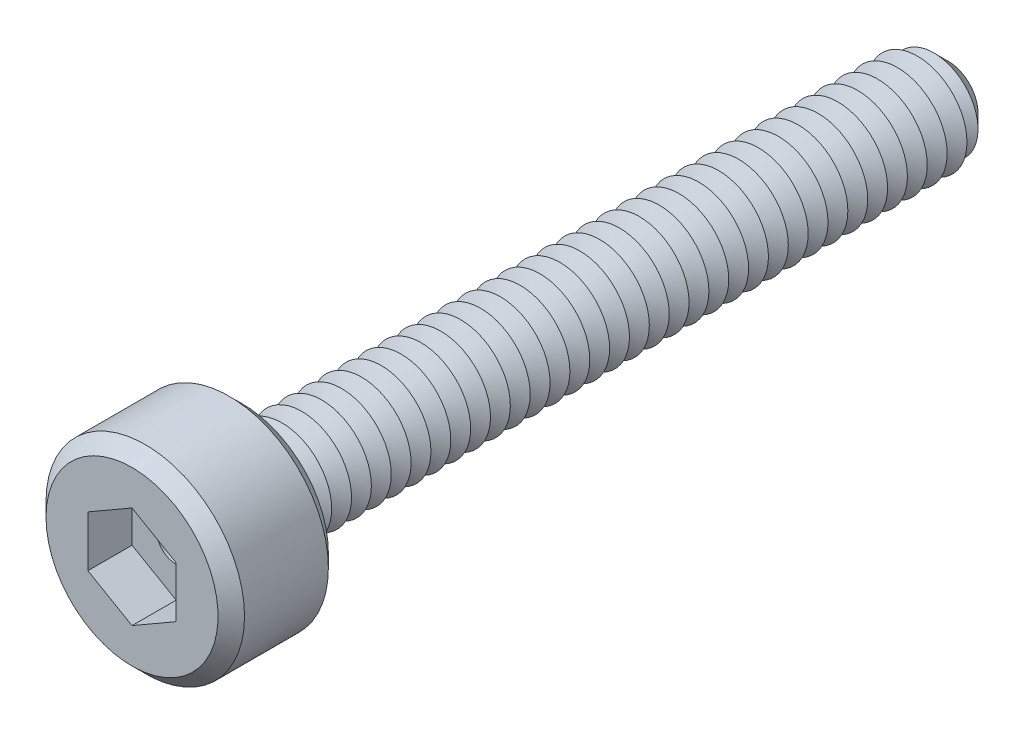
ISO-10303-21;
HEADER;
FILE_DESCRIPTION(('STEP AP214'),'2;1');
FILE_NAME('part.step','',(''),(''),'','','');
FILE_SCHEMA(('AUTOMOTIVE_DESIGN { 1 0 10303 214 1 1 1 1 }'));
ENDSEC;
DATA;
#1=APPLICATION_CONTEXT('core data for automotive mechanical design processes');
#2=APPLICATION_PROTOCOL_DEFINITION('international standard','automotive_design',2000,#1);
#3=PRODUCT_CONTEXT('',#1,'mechanical');
#4=PRODUCT('Part','Part','',(#3));
#5=PRODUCT_RELATED_PRODUCT_CATEGORY('part','',(#4));
#6=PRODUCT_DEFINITION_FORMATION('','',#4);
#7=PRODUCT_DEFINITION_CONTEXT('part definition',#1,'design');
#8=PRODUCT_DEFINITION('design','',#6,#7);
#9=PRODUCT_DEFINITION_SHAPE('','',#8);
#10=(LENGTH_UNIT() NAMED_UNIT(*) SI_UNIT(.MILLI.,.METRE.));
#11=(NAMED_UNIT(*) PLANE_ANGLE_UNIT() SI_UNIT($,.RADIAN.));
#12=(NAMED_UNIT(*) SI_UNIT($,.STERADIAN.) SOLID_ANGLE_UNIT());
#13=UNCERTAINTY_MEASURE_WITH_UNIT(LENGTH_MEASURE(1.E-05),#10,'distance_accuracy_value','');
#14=(GEOMETRIC_REPRESENTATION_CONTEXT(3) GLOBAL_UNCERTAINTY_ASSIGNED_CONTEXT((#13)) GLOBAL_UNIT_ASSIGNED_CONTEXT((#10,
#11,#12)) REPRESENTATION_CONTEXT('',''));
#15=CARTESIAN_POINT('',(0.,0.,0.));
#16=DIRECTION('',(0.,0.,1.));
#17=DIRECTION('',(1.,0.,0.));
#18=AXIS2_PLACEMENT_3D('',#15,#16,#17);
#19=CARTESIAN_POINT('',(0.,0.,2.5));
#20=DIRECTION('',(0.,0.,-1.));
#21=DIRECTION('',(-1.,0.,0.));
#22=AXIS2_PLACEMENT_3D('',#19,#20,#21);
#23=CYLINDRICAL_SURFACE('',#22,2.25);
#24=CARTESIAN_POINT('',(0.,0.,0.299999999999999));
#25=DIRECTION('',(0.,0.,1.));
#26=DIRECTION('',(1.,0.,0.));
#27=AXIS2_PLACEMENT_3D('',#24,#25,#26);
#28=CIRCLE('',#27,2.25);
#29=CARTESIAN_POINT('',(2.25,0.,0.299999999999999));
#30=VERTEX_POINT('',#29);
#31=EDGE_CURVE('E456',#30,#30,#28,.T.);
#32=ORIENTED_EDGE('',*,*,#31,.T.);
#33=EDGE_LOOP('',(#32));
#34=FACE_BOUND('',#33,.T.);
#35=CARTESIAN_POINT('',(0.,0.,2.2));
#36=DIRECTION('',(0.,0.,1.));
#37=DIRECTION('',(1.,0.,0.));
#38=AXIS2_PLACEMENT_3D('',#35,#36,#37);
#39=CIRCLE('',#38,2.25);
#40=CARTESIAN_POINT('',(-2.25,0.,2.2));
#41=VERTEX_POINT('',#40);
#42=EDGE_CURVE('E449',#41,#41,#39,.F.);
#43=ORIENTED_EDGE('',*,*,#42,.T.);
#44=EDGE_LOOP('',(#43));
#45=FACE_BOUND('',#44,.T.);
#46=ADVANCED_FACE('F39',(#34,#45),#23,.T.);
#47=CARTESIAN_POINT('',(0.,0.,2.5));
#48=DIRECTION('',(0.,0.,1.));
#49=DIRECTION('',(1.,0.,0.));
#50=AXIS2_PLACEMENT_3D('',#47,#48,#49);
#51=PLANE('',#50);
#52=CARTESIAN_POINT('',(0.,0.,2.5));
#53=DIRECTION('',(0.,0.,1.));
#54=DIRECTION('',(1.,0.,0.));
#55=AXIS2_PLACEMENT_3D('',#52,#53,#54);
#56=CIRCLE('',#55,1.95);
#57=CARTESIAN_POINT('',(-1.95,0.,2.5));
#58=VERTEX_POINT('',#57);
#59=EDGE_CURVE('E11',#58,#58,#56,.T.);
#60=ORIENTED_EDGE('',*,*,#59,.T.);
#61=EDGE_LOOP('',(#60));
#62=FACE_BOUND('',#61,.T.);
#63=DIRECTION('',(-0.866025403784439,0.5,0.));
#64=VECTOR('',#63,1.);
#65=CARTESIAN_POINT('',(0.999999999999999,0.577350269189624,2.5));
#66=LINE('',#65,#64);
#67=CARTESIAN_POINT('',(0.999999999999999,0.577350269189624,2.5));
#68=VERTEX_POINT('',#67);
#69=CARTESIAN_POINT('',(0.,1.15470053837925,2.5));
#70=VERTEX_POINT('',#69);
#71=EDGE_CURVE('E55',#68,#70,#66,.T.);
#72=ORIENTED_EDGE('',*,*,#71,.F.);
#73=DIRECTION('',(0.,1.,0.));
#74=VECTOR('',#73,1.);
#75=CARTESIAN_POINT('',(1.,-0.577350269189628,2.5));
#76=LINE('',#75,#74);
#77=CARTESIAN_POINT('',(1.,-0.577350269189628,2.5));
#78=VERTEX_POINT('',#77);
#79=EDGE_CURVE('E150',#78,#68,#76,.T.);
#80=ORIENTED_EDGE('',*,*,#79,.F.);
#81=DIRECTION('',(0.866025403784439,0.5,0.));
#82=VECTOR('',#81,1.);
#83=CARTESIAN_POINT('',(0.,-1.15470053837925,2.5));
#84=LINE('',#83,#82);
#85=CARTESIAN_POINT('',(0.,-1.15470053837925,2.5));
#86=VERTEX_POINT('',#85);
#87=EDGE_CURVE('E147',#86,#78,#84,.T.);
#88=ORIENTED_EDGE('',*,*,#87,.F.);
#89=DIRECTION('',(0.866025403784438,-0.5,0.));
#90=VECTOR('',#89,1.);
#91=CARTESIAN_POINT('',(-1.,-0.577350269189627,2.5));
#92=LINE('',#91,#90);
#93=CARTESIAN_POINT('',(-1.,-0.577350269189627,2.5));
#94=VERTEX_POINT('',#93);
#95=EDGE_CURVE('E103',#94,#86,#92,.T.);
#96=ORIENTED_EDGE('',*,*,#95,.F.);
#97=DIRECTION('',(0.,-1.,0.));
#98=VECTOR('',#97,1.);
#99=CARTESIAN_POINT('',(-1.,0.577350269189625,2.5));
#100=LINE('',#99,#98);
#101=CARTESIAN_POINT('',(-1.,0.577350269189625,2.5));
#102=VERTEX_POINT('',#101);
#103=EDGE_CURVE('E141',#102,#94,#100,.T.);
#104=ORIENTED_EDGE('',*,*,#103,.F.);
#105=DIRECTION('',(-0.866025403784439,-0.5,0.));
#106=VECTOR('',#105,1.);
#107=CARTESIAN_POINT('',(0.,1.15470053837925,2.5));
#108=LINE('',#107,#106);
#109=EDGE_CURVE('E136',#70,#102,#108,.T.);
#110=ORIENTED_EDGE('',*,*,#109,.F.);
#111=EDGE_LOOP('',(#72,#80,#88,#96,#104,#110));
#112=FACE_BOUND('',#111,.T.);
#113=ADVANCED_FACE('F474',(#62,#112),#51,.T.);
#114=CARTESIAN_POINT('',(0.,0.,0.));
#115=DIRECTION('',(0.,0.,1.));
#116=DIRECTION('',(1.,0.,0.));
#117=AXIS2_PLACEMENT_3D('',#114,#115,#116);
#118=PLANE('',#117);
#119=CARTESIAN_POINT('',(0.,0.,0.));
#120=DIRECTION('',(0.,0.,1.));
#121=DIRECTION('',(1.,0.,0.));
#122=AXIS2_PLACEMENT_3D('',#119,#120,#121);
#123=CIRCLE('',#122,1.95);
#124=CARTESIAN_POINT('',(1.95,0.,0.));
#125=VERTEX_POINT('',#124);
#126=EDGE_CURVE('E48',#125,#125,#123,.F.);
#127=ORIENTED_EDGE('',*,*,#126,.T.);
#128=EDGE_LOOP('',(#127));
#129=FACE_BOUND('',#128,.T.);
#130=CARTESIAN_POINT('',(0.,0.,0.));
#131=DIRECTION('',(0.,0.,1.));
#132=DIRECTION('',(1.,0.,0.));
#133=AXIS2_PLACEMENT_3D('',#130,#131,#132);
#134=CIRCLE('',#133,1.125);
#135=CARTESIAN_POINT('',(1.125,0.,0.));
#136=VERTEX_POINT('',#135);
#137=EDGE_CURVE('E441',#136,#136,#134,.T.);
#138=ORIENTED_EDGE('',*,*,#137,.T.);
#139=EDGE_LOOP('',(#138));
#140=FACE_BOUND('',#139,.T.);
#141=ADVANCED_FACE('F463',(#129,#140),#118,.F.);
#142=CARTESIAN_POINT('',(0.,0.,0.));
#143=DIRECTION('',(0.,0.,1.));
#144=DIRECTION('',(1.,0.,0.));
#145=AXIS2_PLACEMENT_3D('',#142,#143,#144);
#146=CONICAL_SURFACE('',#145,1.125,1.0471975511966);
#147=CARTESIAN_POINT('',(0.,0.,-0.225));
#148=DIRECTION('',(0.,0.,1.));
#149=DIRECTION('',(1.,0.,0.));
#150=AXIS2_PLACEMENT_3D('',#147,#148,#149);
#151=CIRCLE('',#150,0.735288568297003);
#152=CARTESIAN_POINT('',(0.735288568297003,0.,-0.225));
#153=VERTEX_POINT('',#152);
#154=EDGE_CURVE('E437',#153,#153,#151,.T.);
#155=ORIENTED_EDGE('',*,*,#154,.T.);
#156=EDGE_LOOP('',(#155));
#157=FACE_BOUND('',#156,.T.);
#158=ORIENTED_EDGE('',*,*,#137,.F.);
#159=EDGE_LOOP('',(#158));
#160=FACE_BOUND('',#159,.T.);
#161=ADVANCED_FACE('F804',(#157,#160),#146,.T.);
#162=CARTESIAN_POINT('',(0.,0.,-0.225));
#163=DIRECTION('',(0.,0.,-1.));
#164=DIRECTION('',(-1.,0.,0.));
#165=AXIS2_PLACEMENT_3D('',#162,#163,#164);
#166=CONICAL_SURFACE('',#165,0.735288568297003,1.0471975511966);
#167=CARTESIAN_POINT('',(0.,0.,-0.45));
#168=DIRECTION('',(0.,0.,1.));
#169=DIRECTION('',(1.,0.,0.));
#170=AXIS2_PLACEMENT_3D('',#167,#168,#169);
#171=CIRCLE('',#170,1.125);
#172=CARTESIAN_POINT('',(1.125,0.,-0.45));
#173=VERTEX_POINT('',#172);
#174=EDGE_CURVE('E433',#173,#173,#171,.T.);
#175=ORIENTED_EDGE('',*,*,#174,.T.);
#176=EDGE_LOOP('',(#175));
#177=FACE_BOUND('',#176,.T.);
#178=ORIENTED_EDGE('',*,*,#154,.F.);
#179=EDGE_LOOP('',(#178));
#180=FACE_BOUND('',#179,.T.);
#181=ADVANCED_FACE('F800',(#177,#180),#166,.T.);
#182=CARTESIAN_POINT('',(0.,0.,-0.45));
#183=DIRECTION('',(0.,0.,1.));
#184=DIRECTION('',(1.,0.,0.));
#185=AXIS2_PLACEMENT_3D('',#182,#183,#184);
#186=CONICAL_SURFACE('',#185,1.125,1.0471975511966);
#187=CARTESIAN_POINT('',(0.,0.,-0.675));
#188=DIRECTION('',(0.,0.,1.));
#189=DIRECTION('',(1.,0.,0.));
#190=AXIS2_PLACEMENT_3D('',#187,#188,#189);
#191=CIRCLE('',#190,0.735288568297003);
#192=CARTESIAN_POINT('',(0.735288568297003,0.,-0.675));
#193=VERTEX_POINT('',#192);
#194=EDGE_CURVE('E429',#193,#193,#191,.T.);
#195=ORIENTED_EDGE('',*,*,#194,.T.);
#196=EDGE_LOOP('',(#195));
#197=FACE_BOUND('',#196,.T.);
#198=ORIENTED_EDGE('',*,*,#174,.F.);
#199=EDGE_LOOP('',(#198));
#200=FACE_BOUND('',#199,.T.);
#201=ADVANCED_FACE('F796',(#197,#200),#186,.T.);
#202=CARTESIAN_POINT('',(0.,0.,-0.675));
#203=DIRECTION('',(0.,0.,-1.));
#204=DIRECTION('',(-1.,0.,0.));
#205=AXIS2_PLACEMENT_3D('',#202,#203,#204);
#206=CONICAL_SURFACE('',#205,0.735288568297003,1.0471975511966);
#207=CARTESIAN_POINT('',(0.,0.,-0.9));
#208=DIRECTION('',(0.,0.,1.));
#209=DIRECTION('',(1.,0.,0.));
#210=AXIS2_PLACEMENT_3D('',#207,#208,#209);
#211=CIRCLE('',#210,1.125);
#212=CARTESIAN_POINT('',(1.125,0.,-0.9));
#213=VERTEX_POINT('',#212);
#214=EDGE_CURVE('E425',#213,#213,#211,.T.);
#215=ORIENTED_EDGE('',*,*,#214,.T.);
#216=EDGE_LOOP('',(#215));
#217=FACE_BOUND('',#216,.T.);
#218=ORIENTED_EDGE('',*,*,#194,.F.);
#219=EDGE_LOOP('',(#218));
#220=FACE_BOUND('',#219,.T.);
#221=ADVANCED_FACE('F792',(#217,#220),#206,.T.);
#222=CARTESIAN_POINT('',(0.,0.,-0.9));
#223=DIRECTION('',(0.,0.,1.));
#224=DIRECTION('',(1.,0.,0.));
#225=AXIS2_PLACEMENT_3D('',#222,#223,#224);
#226=CONICAL_SURFACE('',#225,1.125,1.0471975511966);
#227=CARTESIAN_POINT('',(0.,0.,-1.125));
#228=DIRECTION('',(0.,0.,1.));
#229=DIRECTION('',(1.,0.,0.));
#230=AXIS2_PLACEMENT_3D('',#227,#228,#229);
#231=CIRCLE('',#230,0.735288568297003);
#232=CARTESIAN_POINT('',(0.735288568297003,0.,-1.125));
#233=VERTEX_POINT('',#232);
#234=EDGE_CURVE('E421',#233,#233,#231,.T.);
#235=ORIENTED_EDGE('',*,*,#234,.T.);
#236=EDGE_LOOP('',(#235));
#237=FACE_BOUND('',#236,.T.);
#238=ORIENTED_EDGE('',*,*,#214,.F.);
#239=EDGE_LOOP('',(#238));
#240=FACE_BOUND('',#239,.T.);
#241=ADVANCED_FACE('F788',(#237,#240),#226,.T.);
#242=CARTESIAN_POINT('',(0.,0.,-1.125));
#243=DIRECTION('',(0.,0.,-1.));
#244=DIRECTION('',(-1.,0.,0.));
#245=AXIS2_PLACEMENT_3D('',#242,#243,#244);
#246=CONICAL_SURFACE('',#245,0.735288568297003,1.0471975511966);
#247=CARTESIAN_POINT('',(0.,0.,-1.35));
#248=DIRECTION('',(0.,0.,1.));
#249=DIRECTION('',(1.,0.,0.));
#250=AXIS2_PLACEMENT_3D('',#247,#248,#249);
#251=CIRCLE('',#250,1.125);
#252=CARTESIAN_POINT('',(1.125,0.,-1.35));
#253=VERTEX_POINT('',#252);
#254=EDGE_CURVE('E417',#253,#253,#251,.T.);
#255=ORIENTED_EDGE('',*,*,#254,.T.);
#256=EDGE_LOOP('',(#255));
#257=FACE_BOUND('',#256,.T.);
#258=ORIENTED_EDGE('',*,*,#234,.F.);
#259=EDGE_LOOP('',(#258));
#260=FACE_BOUND('',#259,.T.);
#261=ADVANCED_FACE('F784',(#257,#260),#246,.T.);
#262=CARTESIAN_POINT('',(0.,0.,-1.35));
#263=DIRECTION('',(0.,0.,1.));
#264=DIRECTION('',(1.,0.,0.));
#265=AXIS2_PLACEMENT_3D('',#262,#263,#264);
#266=CONICAL_SURFACE('',#265,1.125,1.0471975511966);
#267=CARTESIAN_POINT('',(0.,0.,-1.575));
#268=DIRECTION('',(0.,0.,1.));
#269=DIRECTION('',(1.,0.,0.));
#270=AXIS2_PLACEMENT_3D('',#267,#268,#269);
#271=CIRCLE('',#270,0.735288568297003);
#272=CARTESIAN_POINT('',(0.735288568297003,0.,-1.575));
#273=VERTEX_POINT('',#272);
#274=EDGE_CURVE('E413',#273,#273,#271,.T.);
#275=ORIENTED_EDGE('',*,*,#274,.T.);
#276=EDGE_LOOP('',(#275));
#277=FACE_BOUND('',#276,.T.);
#278=ORIENTED_EDGE('',*,*,#254,.F.);
#279=EDGE_LOOP('',(#278));
#280=FACE_BOUND('',#279,.T.);
#281=ADVANCED_FACE('F780',(#277,#280),#266,.T.);
#282=CARTESIAN_POINT('',(0.,0.,-1.575));
#283=DIRECTION('',(0.,0.,-1.));
#284=DIRECTION('',(-1.,0.,0.));
#285=AXIS2_PLACEMENT_3D('',#282,#283,#284);
#286=CONICAL_SURFACE('',#285,0.735288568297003,1.0471975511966);
#287=CARTESIAN_POINT('',(0.,0.,-1.8));
#288=DIRECTION('',(0.,0.,1.));
#289=DIRECTION('',(1.,0.,0.));
#290=AXIS2_PLACEMENT_3D('',#287,#288,#289);
#291=CIRCLE('',#290,1.125);
#292=CARTESIAN_POINT('',(1.125,0.,-1.8));
#293=VERTEX_POINT('',#292);
#294=EDGE_CURVE('E409',#293,#293,#291,.T.);
#295=ORIENTED_EDGE('',*,*,#294,.T.);
#296=EDGE_LOOP('',(#295));
#297=FACE_BOUND('',#296,.T.);
#298=ORIENTED_EDGE('',*,*,#274,.F.);
#299=EDGE_LOOP('',(#298));
#300=FACE_BOUND('',#299,.T.);
#301=ADVANCED_FACE('F776',(#297,#300),#286,.T.);
#302=CARTESIAN_POINT('',(0.,0.,-1.8));
#303=DIRECTION('',(0.,0.,1.));
#304=DIRECTION('',(1.,0.,0.));
#305=AXIS2_PLACEMENT_3D('',#302,#303,#304);
#306=CONICAL_SURFACE('',#305,1.125,1.0471975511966);
#307=CARTESIAN_POINT('',(0.,0.,-2.025));
#308=DIRECTION('',(0.,0.,1.));
#309=DIRECTION('',(1.,0.,0.));
#310=AXIS2_PLACEMENT_3D('',#307,#308,#309);
#311=CIRCLE('',#310,0.735288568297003);
#312=CARTESIAN_POINT('',(0.735288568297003,0.,-2.025));
#313=VERTEX_POINT('',#312);
#314=EDGE_CURVE('E405',#313,#313,#311,.T.);
#315=ORIENTED_EDGE('',*,*,#314,.T.);
#316=EDGE_LOOP('',(#315));
#317=FACE_BOUND('',#316,.T.);
#318=ORIENTED_EDGE('',*,*,#294,.F.);
#319=EDGE_LOOP('',(#318));
#320=FACE_BOUND('',#319,.T.);
#321=ADVANCED_FACE('F772',(#317,#320),#306,.T.);
#322=CARTESIAN_POINT('',(0.,0.,-2.025));
#323=DIRECTION('',(0.,0.,-1.));
#324=DIRECTION('',(-1.,0.,0.));
#325=AXIS2_PLACEMENT_3D('',#322,#323,#324);
#326=CONICAL_SURFACE('',#325,0.735288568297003,1.0471975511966);
#327=CARTESIAN_POINT('',(0.,0.,-2.25));
#328=DIRECTION('',(0.,0.,1.));
#329=DIRECTION('',(1.,0.,0.));
#330=AXIS2_PLACEMENT_3D('',#327,#328,#329);
#331=CIRCLE('',#330,1.125);
#332=CARTESIAN_POINT('',(1.125,0.,-2.25));
#333=VERTEX_POINT('',#332);
#334=EDGE_CURVE('E401',#333,#333,#331,.T.);
#335=ORIENTED_EDGE('',*,*,#334,.T.);
#336=EDGE_LOOP('',(#335));
#337=FACE_BOUND('',#336,.T.);
#338=ORIENTED_EDGE('',*,*,#314,.F.);
#339=EDGE_LOOP('',(#338));
#340=FACE_BOUND('',#339,.T.);
#341=ADVANCED_FACE('F768',(#337,#340),#326,.T.);
#342=CARTESIAN_POINT('',(0.,0.,-2.25));
#343=DIRECTION('',(0.,0.,1.));
#344=DIRECTION('',(1.,0.,0.));
#345=AXIS2_PLACEMENT_3D('',#342,#343,#344);
#346=CONICAL_SURFACE('',#345,1.125,1.0471975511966);
#347=CARTESIAN_POINT('',(0.,0.,-2.475));
#348=DIRECTION('',(0.,0.,1.));
#349=DIRECTION('',(1.,0.,0.));
#350=AXIS2_PLACEMENT_3D('',#347,#348,#349);
#351=CIRCLE('',#350,0.735288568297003);
#352=CARTESIAN_POINT('',(0.735288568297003,0.,-2.475));
#353=VERTEX_POINT('',#352);
#354=EDGE_CURVE('E398',#353,#353,#351,.T.);
#355=ORIENTED_EDGE('',*,*,#354,.T.);
#356=EDGE_LOOP('',(#355));
#357=FACE_BOUND('',#356,.T.);
#358=ORIENTED_EDGE('',*,*,#334,.F.);
#359=EDGE_LOOP('',(#358));
#360=FACE_BOUND('',#359,.T.);
#361=ADVANCED_FACE('F764',(#357,#360),#346,.T.);
#362=CARTESIAN_POINT('',(0.,0.,-2.475));
#363=DIRECTION('',(0.,0.,-1.));
#364=DIRECTION('',(-1.,0.,0.));
#365=AXIS2_PLACEMENT_3D('',#362,#363,#364);
#366=CONICAL_SURFACE('',#365,0.735288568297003,1.0471975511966);
#367=CARTESIAN_POINT('',(0.,0.,-2.7));
#368=DIRECTION('',(0.,0.,1.));
#369=DIRECTION('',(1.,0.,0.));
#370=AXIS2_PLACEMENT_3D('',#367,#368,#369);
#371=CIRCLE('',#370,1.125);
#372=CARTESIAN_POINT('',(1.125,0.,-2.7));
#373=VERTEX_POINT('',#372);
#374=EDGE_CURVE('E394',#373,#373,#371,.T.);
#375=ORIENTED_EDGE('',*,*,#374,.T.);
#376=EDGE_LOOP('',(#375));
#377=FACE_BOUND('',#376,.T.);
#378=ORIENTED_EDGE('',*,*,#354,.F.);
#379=EDGE_LOOP('',(#378));
#380=FACE_BOUND('',#379,.T.);
#381=ADVANCED_FACE('F760',(#377,#380),#366,.T.);
#382=CARTESIAN_POINT('',(0.,0.,-2.7));
#383=DIRECTION('',(0.,0.,1.));
#384=DIRECTION('',(1.,0.,0.));
#385=AXIS2_PLACEMENT_3D('',#382,#383,#384);
#386=CONICAL_SURFACE('',#385,1.125,1.0471975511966);
#387=CARTESIAN_POINT('',(0.,0.,-2.925));
#388=DIRECTION('',(0.,0.,1.));
#389=DIRECTION('',(1.,0.,0.));
#390=AXIS2_PLACEMENT_3D('',#387,#388,#389);
#391=CIRCLE('',#390,0.735288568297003);
#392=CARTESIAN_POINT('',(0.735288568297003,0.,-2.925));
#393=VERTEX_POINT('',#392);
#394=EDGE_CURVE('E390',#393,#393,#391,.T.);
#395=ORIENTED_EDGE('',*,*,#394,.T.);
#396=EDGE_LOOP('',(#395));
#397=FACE_BOUND('',#396,.T.);
#398=ORIENTED_EDGE('',*,*,#374,.F.);
#399=EDGE_LOOP('',(#398));
#400=FACE_BOUND('',#399,.T.);
#401=ADVANCED_FACE('F756',(#397,#400),#386,.T.);
#402=CARTESIAN_POINT('',(0.,0.,-2.925));
#403=DIRECTION('',(0.,0.,-1.));
#404=DIRECTION('',(-1.,0.,0.));
#405=AXIS2_PLACEMENT_3D('',#402,#403,#404);
#406=CONICAL_SURFACE('',#405,0.735288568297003,1.0471975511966);
#407=CARTESIAN_POINT('',(0.,0.,-3.15));
#408=DIRECTION('',(0.,0.,1.));
#409=DIRECTION('',(1.,0.,0.));
#410=AXIS2_PLACEMENT_3D('',#407,#408,#409);
#411=CIRCLE('',#410,1.125);
#412=CARTESIAN_POINT('',(1.125,0.,-3.15));
#413=VERTEX_POINT('',#412);
#414=EDGE_CURVE('E386',#413,#413,#411,.T.);
#415=ORIENTED_EDGE('',*,*,#414,.T.);
#416=EDGE_LOOP('',(#415));
#417=FACE_BOUND('',#416,.T.);
#418=ORIENTED_EDGE('',*,*,#394,.F.);
#419=EDGE_LOOP('',(#418));
#420=FACE_BOUND('',#419,.T.);
#421=ADVANCED_FACE('F752',(#417,#420),#406,.T.);
#422=CARTESIAN_POINT('',(0.,0.,-3.15));
#423=DIRECTION('',(0.,0.,1.));
#424=DIRECTION('',(1.,0.,0.));
#425=AXIS2_PLACEMENT_3D('',#422,#423,#424);
#426=CONICAL_SURFACE('',#425,1.125,1.0471975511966);
#427=CARTESIAN_POINT('',(0.,0.,-3.375));
#428=DIRECTION('',(0.,0.,1.));
#429=DIRECTION('',(1.,0.,0.));
#430=AXIS2_PLACEMENT_3D('',#427,#428,#429);
#431=CIRCLE('',#430,0.735288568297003);
#432=CARTESIAN_POINT('',(0.735288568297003,0.,-3.375));
#433=VERTEX_POINT('',#432);
#434=EDGE_CURVE('E382',#433,#433,#431,.T.);
#435=ORIENTED_EDGE('',*,*,#434,.T.);
#436=EDGE_LOOP('',(#435));
#437=FACE_BOUND('',#436,.T.);
#438=ORIENTED_EDGE('',*,*,#414,.F.);
#439=EDGE_LOOP('',(#438));
#440=FACE_BOUND('',#439,.T.);
#441=ADVANCED_FACE('F748',(#437,#440),#426,.T.);
#442=CARTESIAN_POINT('',(0.,0.,-3.375));
#443=DIRECTION('',(0.,0.,-1.));
#444=DIRECTION('',(-1.,0.,0.));
#445=AXIS2_PLACEMENT_3D('',#442,#443,#444);
#446=CONICAL_SURFACE('',#445,0.735288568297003,1.0471975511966);
#447=CARTESIAN_POINT('',(0.,0.,-3.6));
#448=DIRECTION('',(0.,0.,1.));
#449=DIRECTION('',(1.,0.,0.));
#450=AXIS2_PLACEMENT_3D('',#447,#448,#449);
#451=CIRCLE('',#450,1.125);
#452=CARTESIAN_POINT('',(1.125,0.,-3.6));
#453=VERTEX_POINT('',#452);
#454=EDGE_CURVE('E378',#453,#453,#451,.T.);
#455=ORIENTED_EDGE('',*,*,#454,.T.);
#456=EDGE_LOOP('',(#455));
#457=FACE_BOUND('',#456,.T.);
#458=ORIENTED_EDGE('',*,*,#434,.F.);
#459=EDGE_LOOP('',(#458));
#460=FACE_BOUND('',#459,.T.);
#461=ADVANCED_FACE('F744',(#457,#460),#446,.T.);
#462=CARTESIAN_POINT('',(0.,0.,-3.6));
#463=DIRECTION('',(0.,0.,1.));
#464=DIRECTION('',(1.,0.,0.));
#465=AXIS2_PLACEMENT_3D('',#462,#463,#464);
#466=CONICAL_SURFACE('',#465,1.125,1.0471975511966);
#467=CARTESIAN_POINT('',(0.,0.,-3.825));
#468=DIRECTION('',(0.,0.,1.));
#469=DIRECTION('',(1.,0.,0.));
#470=AXIS2_PLACEMENT_3D('',#467,#468,#469);
#471=CIRCLE('',#470,0.735288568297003);
#472=CARTESIAN_POINT('',(0.735288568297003,0.,-3.825));
#473=VERTEX_POINT('',#472);
#474=EDGE_CURVE('E374',#473,#473,#471,.T.);
#475=ORIENTED_EDGE('',*,*,#474,.T.);
#476=EDGE_LOOP('',(#475));
#477=FACE_BOUND('',#476,.T.);
#478=ORIENTED_EDGE('',*,*,#454,.F.);
#479=EDGE_LOOP('',(#478));
#480=FACE_BOUND('',#479,.T.);
#481=ADVANCED_FACE('F740',(#477,#480),#466,.T.);
#482=CARTESIAN_POINT('',(0.,0.,-3.825));
#483=DIRECTION('',(0.,0.,-1.));
#484=DIRECTION('',(-1.,0.,0.));
#485=AXIS2_PLACEMENT_3D('',#482,#483,#484);
#486=CONICAL_SURFACE('',#485,0.735288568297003,1.0471975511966);
#487=CARTESIAN_POINT('',(0.,0.,-4.05));
#488=DIRECTION('',(0.,0.,1.));
#489=DIRECTION('',(1.,0.,0.));
#490=AXIS2_PLACEMENT_3D('',#487,#488,#489);
#491=CIRCLE('',#490,1.125);
#492=CARTESIAN_POINT('',(1.125,0.,-4.05));
#493=VERTEX_POINT('',#492);
#494=EDGE_CURVE('E370',#493,#493,#491,.T.);
#495=ORIENTED_EDGE('',*,*,#494,.T.);
#496=EDGE_LOOP('',(#495));
#497=FACE_BOUND('',#496,.T.);
#498=ORIENTED_EDGE('',*,*,#474,.F.);
#499=EDGE_LOOP('',(#498));
#500=FACE_BOUND('',#499,.T.);
#501=ADVANCED_FACE('F736',(#497,#500),#486,.T.);
#502=CARTESIAN_POINT('',(0.,0.,-4.05));
#503=DIRECTION('',(0.,0.,1.));
#504=DIRECTION('',(1.,0.,0.));
#505=AXIS2_PLACEMENT_3D('',#502,#503,#504);
#506=CONICAL_SURFACE('',#505,1.125,1.0471975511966);
#507=CARTESIAN_POINT('',(0.,0.,-4.275));
#508=DIRECTION('',(0.,0.,1.));
#509=DIRECTION('',(1.,0.,0.));
#510=AXIS2_PLACEMENT_3D('',#507,#508,#509);
#511=CIRCLE('',#510,0.735288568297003);
#512=CARTESIAN_POINT('',(0.735288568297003,0.,-4.275));
#513=VERTEX_POINT('',#512);
#514=EDGE_CURVE('E366',#513,#513,#511,.T.);
#515=ORIENTED_EDGE('',*,*,#514,.T.);
#516=EDGE_LOOP('',(#515));
#517=FACE_BOUND('',#516,.T.);
#518=ORIENTED_EDGE('',*,*,#494,.F.);
#519=EDGE_LOOP('',(#518));
#520=FACE_BOUND('',#519,.T.);
#521=ADVANCED_FACE('F732',(#517,#520),#506,.T.);
#522=CARTESIAN_POINT('',(0.,0.,-4.275));
#523=DIRECTION('',(0.,0.,-1.));
#524=DIRECTION('',(-1.,0.,0.));
#525=AXIS2_PLACEMENT_3D('',#522,#523,#524);
#526=CONICAL_SURFACE('',#525,0.735288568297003,1.0471975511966);
#527=CARTESIAN_POINT('',(0.,0.,-4.5));
#528=DIRECTION('',(0.,0.,1.));
#529=DIRECTION('',(1.,0.,0.));
#530=AXIS2_PLACEMENT_3D('',#527,#528,#529);
#531=CIRCLE('',#530,1.125);
#532=CARTESIAN_POINT('',(1.125,0.,-4.5));
#533=VERTEX_POINT('',#532);
#534=EDGE_CURVE('E362',#533,#533,#531,.T.);
#535=ORIENTED_EDGE('',*,*,#534,.T.);
#536=EDGE_LOOP('',(#535));
#537=FACE_BOUND('',#536,.T.);
#538=ORIENTED_EDGE('',*,*,#514,.F.);
#539=EDGE_LOOP('',(#538));
#540=FACE_BOUND('',#539,.T.);
#541=ADVANCED_FACE('F728',(#537,#540),#526,.T.);
#542=CARTESIAN_POINT('',(0.,0.,-4.5));
#543=DIRECTION('',(0.,0.,1.));
#544=DIRECTION('',(1.,0.,0.));
#545=AXIS2_PLACEMENT_3D('',#542,#543,#544);
#546=CONICAL_SURFACE('',#545,1.125,1.0471975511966);
#547=CARTESIAN_POINT('',(0.,0.,-4.725));
#548=DIRECTION('',(0.,0.,1.));
#549=DIRECTION('',(1.,0.,0.));
#550=AXIS2_PLACEMENT_3D('',#547,#548,#549);
#551=CIRCLE('',#550,0.735288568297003);
#552=CARTESIAN_POINT('',(0.735288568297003,0.,-4.725));
#553=VERTEX_POINT('',#552);
#554=EDGE_CURVE('E358',#553,#553,#551,.T.);
#555=ORIENTED_EDGE('',*,*,#554,.T.);
#556=EDGE_LOOP('',(#555));
#557=FACE_BOUND('',#556,.T.);
#558=ORIENTED_EDGE('',*,*,#534,.F.);
#559=EDGE_LOOP('',(#558));
#560=FACE_BOUND('',#559,.T.);
#561=ADVANCED_FACE('F724',(#557,#560),#546,.T.);
#562=CARTESIAN_POINT('',(0.,0.,-4.725));
#563=DIRECTION('',(0.,0.,-1.));
#564=DIRECTION('',(-1.,0.,0.));
#565=AXIS2_PLACEMENT_3D('',#562,#563,#564);
#566=CONICAL_SURFACE('',#565,0.735288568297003,1.0471975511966);
#567=CARTESIAN_POINT('',(0.,0.,-4.95));
#568=DIRECTION('',(0.,0.,1.));
#569=DIRECTION('',(1.,0.,0.));
#570=AXIS2_PLACEMENT_3D('',#567,#568,#569);
#571=CIRCLE('',#570,1.125);
#572=CARTESIAN_POINT('',(1.125,0.,-4.95));
#573=VERTEX_POINT('',#572);
#574=EDGE_CURVE('E354',#573,#573,#571,.T.);
#575=ORIENTED_EDGE('',*,*,#574,.T.);
#576=EDGE_LOOP('',(#575));
#577=FACE_BOUND('',#576,.T.);
#578=ORIENTED_EDGE('',*,*,#554,.F.);
#579=EDGE_LOOP('',(#578));
#580=FACE_BOUND('',#579,.T.);
#581=ADVANCED_FACE('F720',(#577,#580),#566,.T.);
#582=CARTESIAN_POINT('',(0.,0.,-4.95));
#583=DIRECTION('',(0.,0.,1.));
#584=DIRECTION('',(1.,0.,0.));
#585=AXIS2_PLACEMENT_3D('',#582,#583,#584);
#586=CONICAL_SURFACE('',#585,1.125,1.0471975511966);
#587=CARTESIAN_POINT('',(0.,0.,-5.175));
#588=DIRECTION('',(0.,0.,1.));
#589=DIRECTION('',(1.,0.,0.));
#590=AXIS2_PLACEMENT_3D('',#587,#588,#589);
#591=CIRCLE('',#590,0.735288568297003);
#592=CARTESIAN_POINT('',(0.735288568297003,0.,-5.175));
#593=VERTEX_POINT('',#592);
#594=EDGE_CURVE('E350',#593,#593,#591,.T.);
#595=ORIENTED_EDGE('',*,*,#594,.T.);
#596=EDGE_LOOP('',(#595));
#597=FACE_BOUND('',#596,.T.);
#598=ORIENTED_EDGE('',*,*,#574,.F.);
#599=EDGE_LOOP('',(#598));
#600=FACE_BOUND('',#599,.T.);
#601=ADVANCED_FACE('F716',(#597,#600),#586,.T.);
#602=CARTESIAN_POINT('',(0.,0.,-5.175));
#603=DIRECTION('',(0.,0.,-1.));
#604=DIRECTION('',(-1.,0.,0.));
#605=AXIS2_PLACEMENT_3D('',#602,#603,#604);
#606=CONICAL_SURFACE('',#605,0.735288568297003,1.0471975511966);
#607=CARTESIAN_POINT('',(0.,0.,-5.4));
#608=DIRECTION('',(0.,0.,1.));
#609=DIRECTION('',(1.,0.,0.));
#610=AXIS2_PLACEMENT_3D('',#607,#608,#609);
#611=CIRCLE('',#610,1.125);
#612=CARTESIAN_POINT('',(1.125,0.,-5.4));
#613=VERTEX_POINT('',#612);
#614=EDGE_CURVE('E346',#613,#613,#611,.T.);
#615=ORIENTED_EDGE('',*,*,#614,.T.);
#616=EDGE_LOOP('',(#615));
#617=FACE_BOUND('',#616,.T.);
#618=ORIENTED_EDGE('',*,*,#594,.F.);
#619=EDGE_LOOP('',(#618));
#620=FACE_BOUND('',#619,.T.);
#621=ADVANCED_FACE('F712',(#617,#620),#606,.T.);
#622=CARTESIAN_POINT('',(0.,0.,-5.4));
#623=DIRECTION('',(0.,0.,1.));
#624=DIRECTION('',(1.,0.,0.));
#625=AXIS2_PLACEMENT_3D('',#622,#623,#624);
#626=CONICAL_SURFACE('',#625,1.125,1.0471975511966);
#627=CARTESIAN_POINT('',(0.,0.,-5.625));
#628=DIRECTION('',(0.,0.,1.));
#629=DIRECTION('',(1.,0.,0.));
#630=AXIS2_PLACEMENT_3D('',#627,#628,#629);
#631=CIRCLE('',#630,0.735288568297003);
#632=CARTESIAN_POINT('',(0.735288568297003,0.,-5.625));
#633=VERTEX_POINT('',#632);
#634=EDGE_CURVE('E342',#633,#633,#631,.T.);
#635=ORIENTED_EDGE('',*,*,#634,.T.);
#636=EDGE_LOOP('',(#635));
#637=FACE_BOUND('',#636,.T.);
#638=ORIENTED_EDGE('',*,*,#614,.F.);
#639=EDGE_LOOP('',(#638));
#640=FACE_BOUND('',#639,.T.);
#641=ADVANCED_FACE('F708',(#637,#640),#626,.T.);
#642=CARTESIAN_POINT('',(0.,0.,-5.625));
#643=DIRECTION('',(0.,0.,-1.));
#644=DIRECTION('',(-1.,0.,0.));
#645=AXIS2_PLACEMENT_3D('',#642,#643,#644);
#646=CONICAL_SURFACE('',#645,0.735288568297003,1.0471975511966);
#647=CARTESIAN_POINT('',(0.,0.,-5.85));
#648=DIRECTION('',(0.,0.,1.));
#649=DIRECTION('',(1.,0.,0.));
#650=AXIS2_PLACEMENT_3D('',#647,#648,#649);
#651=CIRCLE('',#650,1.125);
#652=CARTESIAN_POINT('',(1.125,0.,-5.85));
#653=VERTEX_POINT('',#652);
#654=EDGE_CURVE('E338',#653,#653,#651,.T.);
#655=ORIENTED_EDGE('',*,*,#654,.T.);
#656=EDGE_LOOP('',(#655));
#657=FACE_BOUND('',#656,.T.);
#658=ORIENTED_EDGE('',*,*,#634,.F.);
#659=EDGE_LOOP('',(#658));
#660=FACE_BOUND('',#659,.T.);
#661=ADVANCED_FACE('F704',(#657,#660),#646,.T.);
#662=CARTESIAN_POINT('',(0.,0.,-5.85));
#663=DIRECTION('',(0.,0.,1.));
#664=DIRECTION('',(1.,0.,0.));
#665=AXIS2_PLACEMENT_3D('',#662,#663,#664);
#666=CONICAL_SURFACE('',#665,1.125,1.0471975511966);
#667=CARTESIAN_POINT('',(0.,0.,-6.075));
#668=DIRECTION('',(0.,0.,1.));
#669=DIRECTION('',(1.,0.,0.));
#670=AXIS2_PLACEMENT_3D('',#667,#668,#669);
#671=CIRCLE('',#670,0.735288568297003);
#672=CARTESIAN_POINT('',(0.735288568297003,0.,-6.075));
#673=VERTEX_POINT('',#672);
#674=EDGE_CURVE('E334',#673,#673,#671,.T.);
#675=ORIENTED_EDGE('',*,*,#674,.T.);
#676=EDGE_LOOP('',(#675));
#677=FACE_BOUND('',#676,.T.);
#678=ORIENTED_EDGE('',*,*,#654,.F.);
#679=EDGE_LOOP('',(#678));
#680=FACE_BOUND('',#679,.T.);
#681=ADVANCED_FACE('F700',(#677,#680),#666,.T.);
#682=CARTESIAN_POINT('',(0.,0.,-6.075));
#683=DIRECTION('',(0.,0.,-1.));
#684=DIRECTION('',(-1.,0.,0.));
#685=AXIS2_PLACEMENT_3D('',#682,#683,#684);
#686=CONICAL_SURFACE('',#685,0.735288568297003,1.0471975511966);
#687=CARTESIAN_POINT('',(0.,0.,-6.3));
#688=DIRECTION('',(0.,0.,1.));
#689=DIRECTION('',(1.,0.,0.));
#690=AXIS2_PLACEMENT_3D('',#687,#688,#689);
#691=CIRCLE('',#690,1.125);
#692=CARTESIAN_POINT('',(1.125,0.,-6.3));
#693=VERTEX_POINT('',#692);
#694=EDGE_CURVE('E330',#693,#693,#691,.T.);
#695=ORIENTED_EDGE('',*,*,#694,.T.);
#696=EDGE_LOOP('',(#695));
#697=FACE_BOUND('',#696,.T.);
#698=ORIENTED_EDGE('',*,*,#674,.F.);
#699=EDGE_LOOP('',(#698));
#700=FACE_BOUND('',#699,.T.);
#701=ADVANCED_FACE('F696',(#697,#700),#686,.T.);
#702=CARTESIAN_POINT('',(0.,0.,-6.3));
#703=DIRECTION('',(0.,0.,1.));
#704=DIRECTION('',(1.,0.,0.));
#705=AXIS2_PLACEMENT_3D('',#702,#703,#704);
#706=CONICAL_SURFACE('',#705,1.125,1.0471975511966);
#707=CARTESIAN_POINT('',(0.,0.,-6.525));
#708=DIRECTION('',(0.,0.,1.));
#709=DIRECTION('',(1.,0.,0.));
#710=AXIS2_PLACEMENT_3D('',#707,#708,#709);
#711=CIRCLE('',#710,0.735288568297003);
#712=CARTESIAN_POINT('',(0.735288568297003,0.,-6.525));
#713=VERTEX_POINT('',#712);
#714=EDGE_CURVE('E326',#713,#713,#711,.T.);
#715=ORIENTED_EDGE('',*,*,#714,.T.);
#716=EDGE_LOOP('',(#715));
#717=FACE_BOUND('',#716,.T.);
#718=ORIENTED_EDGE('',*,*,#694,.F.);
#719=EDGE_LOOP('',(#718));
#720=FACE_BOUND('',#719,.T.);
#721=ADVANCED_FACE('F692',(#717,#720),#706,.T.);
#722=CARTESIAN_POINT('',(0.,0.,-6.525));
#723=DIRECTION('',(0.,0.,-1.));
#724=DIRECTION('',(-1.,0.,0.));
#725=AXIS2_PLACEMENT_3D('',#722,#723,#724);
#726=CONICAL_SURFACE('',#725,0.735288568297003,1.0471975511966);
#727=CARTESIAN_POINT('',(0.,0.,-6.75));
#728=DIRECTION('',(0.,0.,1.));
#729=DIRECTION('',(1.,0.,0.));
#730=AXIS2_PLACEMENT_3D('',#727,#728,#729);
#731=CIRCLE('',#730,1.125);
#732=CARTESIAN_POINT('',(1.125,0.,-6.75));
#733=VERTEX_POINT('',#732);
#734=EDGE_CURVE('E322',#733,#733,#731,.T.);
#735=ORIENTED_EDGE('',*,*,#734,.T.);
#736=EDGE_LOOP('',(#735));
#737=FACE_BOUND('',#736,.T.);
#738=ORIENTED_EDGE('',*,*,#714,.F.);
#739=EDGE_LOOP('',(#738));
#740=FACE_BOUND('',#739,.T.);
#741=ADVANCED_FACE('F688',(#737,#740),#726,.T.);
#742=CARTESIAN_POINT('',(0.,0.,-6.75));
#743=DIRECTION('',(0.,0.,1.));
#744=DIRECTION('',(1.,0.,0.));
#745=AXIS2_PLACEMENT_3D('',#742,#743,#744);
#746=CONICAL_SURFACE('',#745,1.125,1.0471975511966);
#747=CARTESIAN_POINT('',(0.,0.,-6.975));
#748=DIRECTION('',(0.,0.,1.));
#749=DIRECTION('',(1.,0.,0.));
#750=AXIS2_PLACEMENT_3D('',#747,#748,#749);
#751=CIRCLE('',#750,0.735288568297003);
#752=CARTESIAN_POINT('',(0.735288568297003,0.,-6.975));
#753=VERTEX_POINT('',#752);
#754=EDGE_CURVE('E318',#753,#753,#751,.T.);
#755=ORIENTED_EDGE('',*,*,#754,.T.);
#756=EDGE_LOOP('',(#755));
#757=FACE_BOUND('',#756,.T.);
#758=ORIENTED_EDGE('',*,*,#734,.F.);
#759=EDGE_LOOP('',(#758));
#760=FACE_BOUND('',#759,.T.);
#761=ADVANCED_FACE('F684',(#757,#760),#746,.T.);
#762=CARTESIAN_POINT('',(0.,0.,-6.975));
#763=DIRECTION('',(0.,0.,-1.));
#764=DIRECTION('',(-1.,0.,0.));
#765=AXIS2_PLACEMENT_3D('',#762,#763,#764);
#766=CONICAL_SURFACE('',#765,0.735288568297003,1.0471975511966);
#767=CARTESIAN_POINT('',(0.,0.,-7.2));
#768=DIRECTION('',(0.,0.,1.));
#769=DIRECTION('',(1.,0.,0.));
#770=AXIS2_PLACEMENT_3D('',#767,#768,#769);
#771=CIRCLE('',#770,1.125);
#772=CARTESIAN_POINT('',(1.125,0.,-7.2));
#773=VERTEX_POINT('',#772);
#774=EDGE_CURVE('E314',#773,#773,#771,.T.);
#775=ORIENTED_EDGE('',*,*,#774,.T.);
#776=EDGE_LOOP('',(#775));
#777=FACE_BOUND('',#776,.T.);
#778=ORIENTED_EDGE('',*,*,#754,.F.);
#779=EDGE_LOOP('',(#778));
#780=FACE_BOUND('',#779,.T.);
#781=ADVANCED_FACE('F680',(#777,#780),#766,.T.);
#782=CARTESIAN_POINT('',(0.,0.,-7.2));
#783=DIRECTION('',(0.,0.,1.));
#784=DIRECTION('',(1.,0.,0.));
#785=AXIS2_PLACEMENT_3D('',#782,#783,#784);
#786=CONICAL_SURFACE('',#785,1.125,1.0471975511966);
#787=CARTESIAN_POINT('',(0.,0.,-7.425));
#788=DIRECTION('',(0.,0.,1.));
#789=DIRECTION('',(1.,0.,0.));
#790=AXIS2_PLACEMENT_3D('',#787,#788,#789);
#791=CIRCLE('',#790,0.735288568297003);
#792=CARTESIAN_POINT('',(0.735288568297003,0.,-7.425));
#793=VERTEX_POINT('',#792);
#794=EDGE_CURVE('E310',#793,#793,#791,.T.);
#795=ORIENTED_EDGE('',*,*,#794,.T.);
#796=EDGE_LOOP('',(#795));
#797=FACE_BOUND('',#796,.T.);
#798=ORIENTED_EDGE('',*,*,#774,.F.);
#799=EDGE_LOOP('',(#798));
#800=FACE_BOUND('',#799,.T.);
#801=ADVANCED_FACE('F676',(#797,#800),#786,.T.);
#802=CARTESIAN_POINT('',(0.,0.,-7.425));
#803=DIRECTION('',(0.,0.,-1.));
#804=DIRECTION('',(-1.,0.,0.));
#805=AXIS2_PLACEMENT_3D('',#802,#803,#804);
#806=CONICAL_SURFACE('',#805,0.735288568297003,1.0471975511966);
#807=CARTESIAN_POINT('',(0.,0.,-7.65));
#808=DIRECTION('',(0.,0.,1.));
#809=DIRECTION('',(1.,0.,0.));
#810=AXIS2_PLACEMENT_3D('',#807,#808,#809);
#811=CIRCLE('',#810,1.125);
#812=CARTESIAN_POINT('',(1.125,0.,-7.65));
#813=VERTEX_POINT('',#812);
#814=EDGE_CURVE('E306',#813,#813,#811,.T.);
#815=ORIENTED_EDGE('',*,*,#814,.T.);
#816=EDGE_LOOP('',(#815));
#817=FACE_BOUND('',#816,.T.);
#818=ORIENTED_EDGE('',*,*,#794,.F.);
#819=EDGE_LOOP('',(#818));
#820=FACE_BOUND('',#819,.T.);
#821=ADVANCED_FACE('F672',(#817,#820),#806,.T.);
#822=CARTESIAN_POINT('',(0.,0.,-7.65));
#823=DIRECTION('',(0.,0.,1.));
#824=DIRECTION('',(1.,0.,0.));
#825=AXIS2_PLACEMENT_3D('',#822,#823,#824);
#826=CONICAL_SURFACE('',#825,1.125,1.0471975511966);
#827=CARTESIAN_POINT('',(0.,0.,-7.875));
#828=DIRECTION('',(0.,0.,1.));
#829=DIRECTION('',(1.,0.,0.));
#830=AXIS2_PLACEMENT_3D('',#827,#828,#829);
#831=CIRCLE('',#830,0.735288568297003);
#832=CARTESIAN_POINT('',(0.735288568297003,0.,-7.875));
#833=VERTEX_POINT('',#832);
#834=EDGE_CURVE('E302',#833,#833,#831,.T.);
#835=ORIENTED_EDGE('',*,*,#834,.T.);
#836=EDGE_LOOP('',(#835));
#837=FACE_BOUND('',#836,.T.);
#838=ORIENTED_EDGE('',*,*,#814,.F.);
#839=EDGE_LOOP('',(#838));
#840=FACE_BOUND('',#839,.T.);
#841=ADVANCED_FACE('F668',(#837,#840),#826,.T.);
#842=CARTESIAN_POINT('',(0.,0.,-7.875));
#843=DIRECTION('',(0.,0.,-1.));
#844=DIRECTION('',(-1.,0.,0.));
#845=AXIS2_PLACEMENT_3D('',#842,#843,#844);
#846=CONICAL_SURFACE('',#845,0.735288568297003,1.0471975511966);
#847=CARTESIAN_POINT('',(0.,0.,-8.1));
#848=DIRECTION('',(0.,0.,1.));
#849=DIRECTION('',(1.,0.,0.));
#850=AXIS2_PLACEMENT_3D('',#847,#848,#849);
#851=CIRCLE('',#850,1.125);
#852=CARTESIAN_POINT('',(1.125,0.,-8.1));
#853=VERTEX_POINT('',#852);
#854=EDGE_CURVE('E298',#853,#853,#851,.T.);
#855=ORIENTED_EDGE('',*,*,#854,.T.);
#856=EDGE_LOOP('',(#855));
#857=FACE_BOUND('',#856,.T.);
#858=ORIENTED_EDGE('',*,*,#834,.F.);
#859=EDGE_LOOP('',(#858));
#860=FACE_BOUND('',#859,.T.);
#861=ADVANCED_FACE('F664',(#857,#860),#846,.T.);
#862=CARTESIAN_POINT('',(0.,0.,-8.1));
#863=DIRECTION('',(0.,0.,1.));
#864=DIRECTION('',(1.,0.,0.));
#865=AXIS2_PLACEMENT_3D('',#862,#863,#864);
#866=CONICAL_SURFACE('',#865,1.125,1.0471975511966);
#867=CARTESIAN_POINT('',(0.,0.,-8.325));
#868=DIRECTION('',(0.,0.,1.));
#869=DIRECTION('',(1.,0.,0.));
#870=AXIS2_PLACEMENT_3D('',#867,#868,#869);
#871=CIRCLE('',#870,0.735288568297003);
#872=CARTESIAN_POINT('',(0.735288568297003,0.,-8.325));
#873=VERTEX_POINT('',#872);
#874=EDGE_CURVE('E294',#873,#873,#871,.T.);
#875=ORIENTED_EDGE('',*,*,#874,.T.);
#876=EDGE_LOOP('',(#875));
#877=FACE_BOUND('',#876,.T.);
#878=ORIENTED_EDGE('',*,*,#854,.F.);
#879=EDGE_LOOP('',(#878));
#880=FACE_BOUND('',#879,.T.);
#881=ADVANCED_FACE('F660',(#877,#880),#866,.T.);
#882=CARTESIAN_POINT('',(0.,0.,-8.325));
#883=DIRECTION('',(0.,0.,-1.));
#884=DIRECTION('',(-1.,0.,0.));
#885=AXIS2_PLACEMENT_3D('',#882,#883,#884);
#886=CONICAL_SURFACE('',#885,0.735288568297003,1.0471975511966);
#887=CARTESIAN_POINT('',(0.,0.,-8.55));
#888=DIRECTION('',(0.,0.,1.));
#889=DIRECTION('',(1.,0.,0.));
#890=AXIS2_PLACEMENT_3D('',#887,#888,#889);
#891=CIRCLE('',#890,1.125);
#892=CARTESIAN_POINT('',(1.125,0.,-8.55));
#893=VERTEX_POINT('',#892);
#894=EDGE_CURVE('E290',#893,#893,#891,.T.);
#895=ORIENTED_EDGE('',*,*,#894,.T.);
#896=EDGE_LOOP('',(#895));
#897=FACE_BOUND('',#896,.T.);
#898=ORIENTED_EDGE('',*,*,#874,.F.);
#899=EDGE_LOOP('',(#898));
#900=FACE_BOUND('',#899,.T.);
#901=ADVANCED_FACE('F656',(#897,#900),#886,.T.);
#902=CARTESIAN_POINT('',(0.,0.,-8.55));
#903=DIRECTION('',(0.,0.,1.));
#904=DIRECTION('',(1.,0.,0.));
#905=AXIS2_PLACEMENT_3D('',#902,#903,#904);
#906=CONICAL_SURFACE('',#905,1.125,1.0471975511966);
#907=CARTESIAN_POINT('',(0.,0.,-8.775));
#908=DIRECTION('',(0.,0.,1.));
#909=DIRECTION('',(1.,0.,0.));
#910=AXIS2_PLACEMENT_3D('',#907,#908,#909);
#911=CIRCLE('',#910,0.735288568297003);
#912=CARTESIAN_POINT('',(0.735288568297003,0.,-8.775));
#913=VERTEX_POINT('',#912);
#914=EDGE_CURVE('E286',#913,#913,#911,.T.);
#915=ORIENTED_EDGE('',*,*,#914,.T.);
#916=EDGE_LOOP('',(#915));
#917=FACE_BOUND('',#916,.T.);
#918=ORIENTED_EDGE('',*,*,#894,.F.);
#919=EDGE_LOOP('',(#918));
#920=FACE_BOUND('',#919,.T.);
#921=ADVANCED_FACE('F652',(#917,#920),#906,.T.);
#922=CARTESIAN_POINT('',(0.,0.,-8.775));
#923=DIRECTION('',(0.,0.,-1.));
#924=DIRECTION('',(-1.,0.,0.));
#925=AXIS2_PLACEMENT_3D('',#922,#923,#924);
#926=CONICAL_SURFACE('',#925,0.735288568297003,1.0471975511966);
#927=CARTESIAN_POINT('',(0.,0.,-9.));
#928=DIRECTION('',(0.,0.,1.));
#929=DIRECTION('',(1.,0.,0.));
#930=AXIS2_PLACEMENT_3D('',#927,#928,#929);
#931=CIRCLE('',#930,1.125);
#932=CARTESIAN_POINT('',(1.125,0.,-9.));
#933=VERTEX_POINT('',#932);
#934=EDGE_CURVE('E282',#933,#933,#931,.T.);
#935=ORIENTED_EDGE('',*,*,#934,.T.);
#936=EDGE_LOOP('',(#935));
#937=FACE_BOUND('',#936,.T.);
#938=ORIENTED_EDGE('',*,*,#914,.F.);
#939=EDGE_LOOP('',(#938));
#940=FACE_BOUND('',#939,.T.);
#941=ADVANCED_FACE('F648',(#937,#940),#926,.T.);
#942=CARTESIAN_POINT('',(0.,0.,-9.));
#943=DIRECTION('',(0.,0.,1.));
#944=DIRECTION('',(1.,0.,0.));
#945=AXIS2_PLACEMENT_3D('',#942,#943,#944);
#946=CONICAL_SURFACE('',#945,1.125,1.0471975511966);
#947=CARTESIAN_POINT('',(0.,0.,-9.225));
#948=DIRECTION('',(0.,0.,1.));
#949=DIRECTION('',(1.,0.,0.));
#950=AXIS2_PLACEMENT_3D('',#947,#948,#949);
#951=CIRCLE('',#950,0.735288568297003);
#952=CARTESIAN_POINT('',(0.735288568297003,0.,-9.225));
#953=VERTEX_POINT('',#952);
#954=EDGE_CURVE('E278',#953,#953,#951,.T.);
#955=ORIENTED_EDGE('',*,*,#954,.T.);
#956=EDGE_LOOP('',(#955));
#957=FACE_BOUND('',#956,.T.);
#958=ORIENTED_EDGE('',*,*,#934,.F.);
#959=EDGE_LOOP('',(#958));
#960=FACE_BOUND('',#959,.T.);
#961=ADVANCED_FACE('F644',(#957,#960),#946,.T.);
#962=CARTESIAN_POINT('',(0.,0.,-9.225));
#963=DIRECTION('',(0.,0.,-1.));
#964=DIRECTION('',(-1.,0.,0.));
#965=AXIS2_PLACEMENT_3D('',#962,#963,#964);
#966=CONICAL_SURFACE('',#965,0.735288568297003,1.0471975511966);
#967=CARTESIAN_POINT('',(0.,0.,-9.45));
#968=DIRECTION('',(0.,0.,1.));
#969=DIRECTION('',(1.,0.,0.));
#970=AXIS2_PLACEMENT_3D('',#967,#968,#969);
#971=CIRCLE('',#970,1.125);
#972=CARTESIAN_POINT('',(1.125,0.,-9.45));
#973=VERTEX_POINT('',#972);
#974=EDGE_CURVE('E274',#973,#973,#971,.T.);
#975=ORIENTED_EDGE('',*,*,#974,.T.);
#976=EDGE_LOOP('',(#975));
#977=FACE_BOUND('',#976,.T.);
#978=ORIENTED_EDGE('',*,*,#954,.F.);
#979=EDGE_LOOP('',(#978));
#980=FACE_BOUND('',#979,.T.);
#981=ADVANCED_FACE('F640',(#977,#980),#966,.T.);
#982=CARTESIAN_POINT('',(0.,0.,-9.45));
#983=DIRECTION('',(0.,0.,1.));
#984=DIRECTION('',(1.,0.,0.));
#985=AXIS2_PLACEMENT_3D('',#982,#983,#984);
#986=CONICAL_SURFACE('',#985,1.125,1.0471975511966);
#987=CARTESIAN_POINT('',(0.,0.,-9.675));
#988=DIRECTION('',(0.,0.,1.));
#989=DIRECTION('',(1.,0.,0.));
#990=AXIS2_PLACEMENT_3D('',#987,#988,#989);
#991=CIRCLE('',#990,0.735288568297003);
#992=CARTESIAN_POINT('',(0.735288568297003,0.,-9.675));
#993=VERTEX_POINT('',#992);
#994=EDGE_CURVE('E270',#993,#993,#991,.T.);
#995=ORIENTED_EDGE('',*,*,#994,.T.);
#996=EDGE_LOOP('',(#995));
#997=FACE_BOUND('',#996,.T.);
#998=ORIENTED_EDGE('',*,*,#974,.F.);
#999=EDGE_LOOP('',(#998));
#1000=FACE_BOUND('',#999,.T.);
#1001=ADVANCED_FACE('F636',(#997,#1000),#986,.T.);
#1002=CARTESIAN_POINT('',(0.,0.,-9.675));
#1003=DIRECTION('',(0.,0.,-1.));
#1004=DIRECTION('',(-1.,0.,0.));
#1005=AXIS2_PLACEMENT_3D('',#1002,#1003,#1004);
#1006=CONICAL_SURFACE('',#1005,0.735288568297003,1.0471975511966);
#1007=CARTESIAN_POINT('',(0.,0.,-9.9));
#1008=DIRECTION('',(0.,0.,1.));
#1009=DIRECTION('',(1.,0.,0.));
#1010=AXIS2_PLACEMENT_3D('',#1007,#1008,#1009);
#1011=CIRCLE('',#1010,1.125);
#1012=CARTESIAN_POINT('',(1.125,0.,-9.9));
#1013=VERTEX_POINT('',#1012);
#1014=EDGE_CURVE('E266',#1013,#1013,#1011,.T.);
#1015=ORIENTED_EDGE('',*,*,#1014,.T.);
#1016=EDGE_LOOP('',(#1015));
#1017=FACE_BOUND('',#1016,.T.);
#1018=ORIENTED_EDGE('',*,*,#994,.F.);
#1019=EDGE_LOOP('',(#1018));
#1020=FACE_BOUND('',#1019,.T.);
#1021=ADVANCED_FACE('F632',(#1017,#1020),#1006,.T.);
#1022=CARTESIAN_POINT('',(0.,0.,-9.9));
#1023=DIRECTION('',(0.,0.,1.));
#1024=DIRECTION('',(1.,0.,0.));
#1025=AXIS2_PLACEMENT_3D('',#1022,#1023,#1024);
#1026=CONICAL_SURFACE('',#1025,1.125,1.0471975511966);
#1027=CARTESIAN_POINT('',(0.,0.,-10.125));
#1028=DIRECTION('',(0.,0.,1.));
#1029=DIRECTION('',(1.,0.,0.));
#1030=AXIS2_PLACEMENT_3D('',#1027,#1028,#1029);
#1031=CIRCLE('',#1030,0.735288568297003);
#1032=CARTESIAN_POINT('',(0.735288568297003,0.,-10.125));
#1033=VERTEX_POINT('',#1032);
#1034=EDGE_CURVE('E262',#1033,#1033,#1031,.T.);
#1035=ORIENTED_EDGE('',*,*,#1034,.T.);
#1036=EDGE_LOOP('',(#1035));
#1037=FACE_BOUND('',#1036,.T.);
#1038=ORIENTED_EDGE('',*,*,#1014,.F.);
#1039=EDGE_LOOP('',(#1038));
#1040=FACE_BOUND('',#1039,.T.);
#1041=ADVANCED_FACE('F628',(#1037,#1040),#1026,.T.);
#1042=CARTESIAN_POINT('',(0.,0.,-10.125));
#1043=DIRECTION('',(0.,0.,-1.));
#1044=DIRECTION('',(-1.,0.,0.));
#1045=AXIS2_PLACEMENT_3D('',#1042,#1043,#1044);
#1046=CONICAL_SURFACE('',#1045,0.735288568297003,1.0471975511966);
#1047=CARTESIAN_POINT('',(0.,0.,-10.35));
#1048=DIRECTION('',(0.,0.,1.));
#1049=DIRECTION('',(1.,0.,0.));
#1050=AXIS2_PLACEMENT_3D('',#1047,#1048,#1049);
#1051=CIRCLE('',#1050,1.125);
#1052=CARTESIAN_POINT('',(1.125,0.,-10.35));
#1053=VERTEX_POINT('',#1052);
#1054=EDGE_CURVE('E258',#1053,#1053,#1051,.T.);
#1055=ORIENTED_EDGE('',*,*,#1054,.T.);
#1056=EDGE_LOOP('',(#1055));
#1057=FACE_BOUND('',#1056,.T.);
#1058=ORIENTED_EDGE('',*,*,#1034,.F.);
#1059=EDGE_LOOP('',(#1058));
#1060=FACE_BOUND('',#1059,.T.);
#1061=ADVANCED_FACE('F624',(#1057,#1060),#1046,.T.);
#1062=CARTESIAN_POINT('',(0.,0.,-10.35));
#1063=DIRECTION('',(0.,0.,1.));
#1064=DIRECTION('',(1.,0.,0.));
#1065=AXIS2_PLACEMENT_3D('',#1062,#1063,#1064);
#1066=CONICAL_SURFACE('',#1065,1.125,1.0471975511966);
#1067=CARTESIAN_POINT('',(0.,0.,-10.575));
#1068=DIRECTION('',(0.,0.,1.));
#1069=DIRECTION('',(1.,0.,0.));
#1070=AXIS2_PLACEMENT_3D('',#1067,#1068,#1069);
#1071=CIRCLE('',#1070,0.735288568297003);
#1072=CARTESIAN_POINT('',(0.735288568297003,0.,-10.575));
#1073=VERTEX_POINT('',#1072);
#1074=EDGE_CURVE('E254',#1073,#1073,#1071,.T.);
#1075=ORIENTED_EDGE('',*,*,#1074,.T.);
#1076=EDGE_LOOP('',(#1075));
#1077=FACE_BOUND('',#1076,.T.);
#1078=ORIENTED_EDGE('',*,*,#1054,.F.);
#1079=EDGE_LOOP('',(#1078));
#1080=FACE_BOUND('',#1079,.T.);
#1081=ADVANCED_FACE('F620',(#1077,#1080),#1066,.T.);
#1082=CARTESIAN_POINT('',(0.,0.,-10.575));
#1083=DIRECTION('',(0.,0.,-1.));
#1084=DIRECTION('',(-1.,0.,0.));
#1085=AXIS2_PLACEMENT_3D('',#1082,#1083,#1084);
#1086=CONICAL_SURFACE('',#1085,0.735288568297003,1.0471975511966);
#1087=CARTESIAN_POINT('',(0.,0.,-10.8));
#1088=DIRECTION('',(0.,0.,1.));
#1089=DIRECTION('',(1.,0.,0.));
#1090=AXIS2_PLACEMENT_3D('',#1087,#1088,#1089);
#1091=CIRCLE('',#1090,1.125);
#1092=CARTESIAN_POINT('',(1.125,0.,-10.8));
#1093=VERTEX_POINT('',#1092);
#1094=EDGE_CURVE('E250',#1093,#1093,#1091,.T.);
#1095=ORIENTED_EDGE('',*,*,#1094,.T.);
#1096=EDGE_LOOP('',(#1095));
#1097=FACE_BOUND('',#1096,.T.);
#1098=ORIENTED_EDGE('',*,*,#1074,.F.);
#1099=EDGE_LOOP('',(#1098));
#1100=FACE_BOUND('',#1099,.T.);
#1101=ADVANCED_FACE('F616',(#1097,#1100),#1086,.T.);
#1102=CARTESIAN_POINT('',(0.,0.,-10.8));
#1103=DIRECTION('',(0.,0.,1.));
#1104=DIRECTION('',(1.,0.,0.));
#1105=AXIS2_PLACEMENT_3D('',#1102,#1103,#1104);
#1106=CONICAL_SURFACE('',#1105,1.125,1.0471975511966);
#1107=CARTESIAN_POINT('',(0.,0.,-11.025));
#1108=DIRECTION('',(0.,0.,1.));
#1109=DIRECTION('',(1.,0.,0.));
#1110=AXIS2_PLACEMENT_3D('',#1107,#1108,#1109);
#1111=CIRCLE('',#1110,0.735288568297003);
#1112=CARTESIAN_POINT('',(0.735288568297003,0.,-11.025));
#1113=VERTEX_POINT('',#1112);
#1114=EDGE_CURVE('E246',#1113,#1113,#1111,.T.);
#1115=ORIENTED_EDGE('',*,*,#1114,.T.);
#1116=EDGE_LOOP('',(#1115));
#1117=FACE_BOUND('',#1116,.T.);
#1118=ORIENTED_EDGE('',*,*,#1094,.F.);
#1119=EDGE_LOOP('',(#1118));
#1120=FACE_BOUND('',#1119,.T.);
#1121=ADVANCED_FACE('F612',(#1117,#1120),#1106,.T.);
#1122=CARTESIAN_POINT('',(0.,0.,-11.025));
#1123=DIRECTION('',(0.,0.,-1.));
#1124=DIRECTION('',(-1.,0.,0.));
#1125=AXIS2_PLACEMENT_3D('',#1122,#1123,#1124);
#1126=CONICAL_SURFACE('',#1125,0.735288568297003,1.0471975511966);
#1127=CARTESIAN_POINT('',(0.,0.,-11.25));
#1128=DIRECTION('',(0.,0.,1.));
#1129=DIRECTION('',(1.,0.,0.));
#1130=AXIS2_PLACEMENT_3D('',#1127,#1128,#1129);
#1131=CIRCLE('',#1130,1.125);
#1132=CARTESIAN_POINT('',(1.125,0.,-11.25));
#1133=VERTEX_POINT('',#1132);
#1134=EDGE_CURVE('E242',#1133,#1133,#1131,.T.);
#1135=ORIENTED_EDGE('',*,*,#1134,.T.);
#1136=EDGE_LOOP('',(#1135));
#1137=FACE_BOUND('',#1136,.T.);
#1138=ORIENTED_EDGE('',*,*,#1114,.F.);
#1139=EDGE_LOOP('',(#1138));
#1140=FACE_BOUND('',#1139,.T.);
#1141=ADVANCED_FACE('F608',(#1137,#1140),#1126,.T.);
#1142=CARTESIAN_POINT('',(0.,0.,-11.25));
#1143=DIRECTION('',(0.,0.,1.));
#1144=DIRECTION('',(1.,0.,0.));
#1145=AXIS2_PLACEMENT_3D('',#1142,#1143,#1144);
#1146=CONICAL_SURFACE('',#1145,1.125,1.0471975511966);
#1147=CARTESIAN_POINT('',(0.,0.,-11.475));
#1148=DIRECTION('',(0.,0.,1.));
#1149=DIRECTION('',(1.,0.,0.));
#1150=AXIS2_PLACEMENT_3D('',#1147,#1148,#1149);
#1151=CIRCLE('',#1150,0.735288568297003);
#1152=CARTESIAN_POINT('',(0.735288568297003,0.,-11.475));
#1153=VERTEX_POINT('',#1152);
#1154=EDGE_CURVE('E238',#1153,#1153,#1151,.T.);
#1155=ORIENTED_EDGE('',*,*,#1154,.T.);
#1156=EDGE_LOOP('',(#1155));
#1157=FACE_BOUND('',#1156,.T.);
#1158=ORIENTED_EDGE('',*,*,#1134,.F.);
#1159=EDGE_LOOP('',(#1158));
#1160=FACE_BOUND('',#1159,.T.);
#1161=ADVANCED_FACE('F604',(#1157,#1160),#1146,.T.);
#1162=CARTESIAN_POINT('',(0.,0.,-11.475));
#1163=DIRECTION('',(0.,0.,-1.));
#1164=DIRECTION('',(-1.,0.,0.));
#1165=AXIS2_PLACEMENT_3D('',#1162,#1163,#1164);
#1166=CONICAL_SURFACE('',#1165,0.735288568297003,1.0471975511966);
#1167=CARTESIAN_POINT('',(0.,0.,-11.7));
#1168=DIRECTION('',(0.,0.,1.));
#1169=DIRECTION('',(1.,0.,0.));
#1170=AXIS2_PLACEMENT_3D('',#1167,#1168,#1169);
#1171=CIRCLE('',#1170,1.125);
#1172=CARTESIAN_POINT('',(1.125,0.,-11.7));
#1173=VERTEX_POINT('',#1172);
#1174=EDGE_CURVE('E234',#1173,#1173,#1171,.T.);
#1175=ORIENTED_EDGE('',*,*,#1174,.T.);
#1176=EDGE_LOOP('',(#1175));
#1177=FACE_BOUND('',#1176,.T.);
#1178=ORIENTED_EDGE('',*,*,#1154,.F.);
#1179=EDGE_LOOP('',(#1178));
#1180=FACE_BOUND('',#1179,.T.);
#1181=ADVANCED_FACE('F600',(#1177,#1180),#1166,.T.);
#1182=CARTESIAN_POINT('',(0.,0.,-11.7));
#1183=DIRECTION('',(0.,0.,1.));
#1184=DIRECTION('',(1.,0.,0.));
#1185=AXIS2_PLACEMENT_3D('',#1182,#1183,#1184);
#1186=CONICAL_SURFACE('',#1185,1.125,1.0471975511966);
#1187=CARTESIAN_POINT('',(0.,0.,-11.925));
#1188=DIRECTION('',(0.,0.,1.));
#1189=DIRECTION('',(1.,0.,0.));
#1190=AXIS2_PLACEMENT_3D('',#1187,#1188,#1189);
#1191=CIRCLE('',#1190,0.735288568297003);
#1192=CARTESIAN_POINT('',(0.735288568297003,0.,-11.925));
#1193=VERTEX_POINT('',#1192);
#1194=EDGE_CURVE('E230',#1193,#1193,#1191,.T.);
#1195=ORIENTED_EDGE('',*,*,#1194,.T.);
#1196=EDGE_LOOP('',(#1195));
#1197=FACE_BOUND('',#1196,.T.);
#1198=ORIENTED_EDGE('',*,*,#1174,.F.);
#1199=EDGE_LOOP('',(#1198));
#1200=FACE_BOUND('',#1199,.T.);
#1201=ADVANCED_FACE('F596',(#1197,#1200),#1186,.T.);
#1202=CARTESIAN_POINT('',(0.,0.,-11.925));
#1203=DIRECTION('',(0.,0.,-1.));
#1204=DIRECTION('',(-1.,0.,0.));
#1205=AXIS2_PLACEMENT_3D('',#1202,#1203,#1204);
#1206=CONICAL_SURFACE('',#1205,0.735288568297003,1.0471975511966);
#1207=CARTESIAN_POINT('',(0.,0.,-12.15));
#1208=DIRECTION('',(0.,0.,1.));
#1209=DIRECTION('',(1.,0.,0.));
#1210=AXIS2_PLACEMENT_3D('',#1207,#1208,#1209);
#1211=CIRCLE('',#1210,1.125);
#1212=CARTESIAN_POINT('',(1.125,0.,-12.15));
#1213=VERTEX_POINT('',#1212);
#1214=EDGE_CURVE('E226',#1213,#1213,#1211,.T.);
#1215=ORIENTED_EDGE('',*,*,#1214,.T.);
#1216=EDGE_LOOP('',(#1215));
#1217=FACE_BOUND('',#1216,.T.);
#1218=ORIENTED_EDGE('',*,*,#1194,.F.);
#1219=EDGE_LOOP('',(#1218));
#1220=FACE_BOUND('',#1219,.T.);
#1221=ADVANCED_FACE('F592',(#1217,#1220),#1206,.T.);
#1222=CARTESIAN_POINT('',(0.,0.,-12.15));
#1223=DIRECTION('',(0.,0.,1.));
#1224=DIRECTION('',(1.,0.,0.));
#1225=AXIS2_PLACEMENT_3D('',#1222,#1223,#1224);
#1226=CONICAL_SURFACE('',#1225,1.125,1.0471975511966);
#1227=CARTESIAN_POINT('',(0.,0.,-12.375));
#1228=DIRECTION('',(0.,0.,1.));
#1229=DIRECTION('',(1.,0.,0.));
#1230=AXIS2_PLACEMENT_3D('',#1227,#1228,#1229);
#1231=CIRCLE('',#1230,0.735288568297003);
#1232=CARTESIAN_POINT('',(0.735288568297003,0.,-12.375));
#1233=VERTEX_POINT('',#1232);
#1234=EDGE_CURVE('E222',#1233,#1233,#1231,.T.);
#1235=ORIENTED_EDGE('',*,*,#1234,.T.);
#1236=EDGE_LOOP('',(#1235));
#1237=FACE_BOUND('',#1236,.T.);
#1238=ORIENTED_EDGE('',*,*,#1214,.F.);
#1239=EDGE_LOOP('',(#1238));
#1240=FACE_BOUND('',#1239,.T.);
#1241=ADVANCED_FACE('F588',(#1237,#1240),#1226,.T.);
#1242=CARTESIAN_POINT('',(0.,0.,-12.375));
#1243=DIRECTION('',(0.,0.,-1.));
#1244=DIRECTION('',(-1.,0.,0.));
#1245=AXIS2_PLACEMENT_3D('',#1242,#1243,#1244);
#1246=CONICAL_SURFACE('',#1245,0.735288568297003,1.0471975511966);
#1247=CARTESIAN_POINT('',(0.,0.,-12.6));
#1248=DIRECTION('',(0.,0.,1.));
#1249=DIRECTION('',(1.,0.,0.));
#1250=AXIS2_PLACEMENT_3D('',#1247,#1248,#1249);
#1251=CIRCLE('',#1250,1.125);
#1252=CARTESIAN_POINT('',(1.125,0.,-12.6));
#1253=VERTEX_POINT('',#1252);
#1254=EDGE_CURVE('E218',#1253,#1253,#1251,.T.);
#1255=ORIENTED_EDGE('',*,*,#1254,.T.);
#1256=EDGE_LOOP('',(#1255));
#1257=FACE_BOUND('',#1256,.T.);
#1258=ORIENTED_EDGE('',*,*,#1234,.F.);
#1259=EDGE_LOOP('',(#1258));
#1260=FACE_BOUND('',#1259,.T.);
#1261=ADVANCED_FACE('F584',(#1257,#1260),#1246,.T.);
#1262=CARTESIAN_POINT('',(0.,0.,-12.6));
#1263=DIRECTION('',(0.,0.,1.));
#1264=DIRECTION('',(1.,0.,0.));
#1265=AXIS2_PLACEMENT_3D('',#1262,#1263,#1264);
#1266=CONICAL_SURFACE('',#1265,1.125,1.0471975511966);
#1267=CARTESIAN_POINT('',(0.,0.,-12.825));
#1268=DIRECTION('',(0.,0.,1.));
#1269=DIRECTION('',(1.,0.,0.));
#1270=AXIS2_PLACEMENT_3D('',#1267,#1268,#1269);
#1271=CIRCLE('',#1270,0.735288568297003);
#1272=CARTESIAN_POINT('',(0.735288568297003,0.,-12.825));
#1273=VERTEX_POINT('',#1272);
#1274=EDGE_CURVE('E214',#1273,#1273,#1271,.T.);
#1275=ORIENTED_EDGE('',*,*,#1274,.T.);
#1276=EDGE_LOOP('',(#1275));
#1277=FACE_BOUND('',#1276,.T.);
#1278=ORIENTED_EDGE('',*,*,#1254,.F.);
#1279=EDGE_LOOP('',(#1278));
#1280=FACE_BOUND('',#1279,.T.);
#1281=ADVANCED_FACE('F580',(#1277,#1280),#1266,.T.);
#1282=CARTESIAN_POINT('',(0.,0.,-12.825));
#1283=DIRECTION('',(0.,0.,-1.));
#1284=DIRECTION('',(-1.,0.,0.));
#1285=AXIS2_PLACEMENT_3D('',#1282,#1283,#1284);
#1286=CONICAL_SURFACE('',#1285,0.735288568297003,1.0471975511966);
#1287=CARTESIAN_POINT('',(0.,0.,-13.05));
#1288=DIRECTION('',(0.,0.,1.));
#1289=DIRECTION('',(1.,0.,0.));
#1290=AXIS2_PLACEMENT_3D('',#1287,#1288,#1289);
#1291=CIRCLE('',#1290,1.125);
#1292=CARTESIAN_POINT('',(1.125,0.,-13.05));
#1293=VERTEX_POINT('',#1292);
#1294=EDGE_CURVE('E210',#1293,#1293,#1291,.T.);
#1295=ORIENTED_EDGE('',*,*,#1294,.T.);
#1296=EDGE_LOOP('',(#1295));
#1297=FACE_BOUND('',#1296,.T.);
#1298=ORIENTED_EDGE('',*,*,#1274,.F.);
#1299=EDGE_LOOP('',(#1298));
#1300=FACE_BOUND('',#1299,.T.);
#1301=ADVANCED_FACE('F576',(#1297,#1300),#1286,.T.);
#1302=CARTESIAN_POINT('',(0.,0.,-13.05));
#1303=DIRECTION('',(0.,0.,1.));
#1304=DIRECTION('',(1.,0.,0.));
#1305=AXIS2_PLACEMENT_3D('',#1302,#1303,#1304);
#1306=CONICAL_SURFACE('',#1305,1.125,1.0471975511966);
#1307=CARTESIAN_POINT('',(0.,0.,-13.275));
#1308=DIRECTION('',(0.,0.,1.));
#1309=DIRECTION('',(1.,0.,0.));
#1310=AXIS2_PLACEMENT_3D('',#1307,#1308,#1309);
#1311=CIRCLE('',#1310,0.735288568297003);
#1312=CARTESIAN_POINT('',(0.735288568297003,0.,-13.275));
#1313=VERTEX_POINT('',#1312);
#1314=EDGE_CURVE('E206',#1313,#1313,#1311,.T.);
#1315=ORIENTED_EDGE('',*,*,#1314,.T.);
#1316=EDGE_LOOP('',(#1315));
#1317=FACE_BOUND('',#1316,.T.);
#1318=ORIENTED_EDGE('',*,*,#1294,.F.);
#1319=EDGE_LOOP('',(#1318));
#1320=FACE_BOUND('',#1319,.T.);
#1321=ADVANCED_FACE('F572',(#1317,#1320),#1306,.T.);
#1322=CARTESIAN_POINT('',(0.,0.,-13.275));
#1323=DIRECTION('',(0.,0.,-1.));
#1324=DIRECTION('',(-1.,0.,0.));
#1325=AXIS2_PLACEMENT_3D('',#1322,#1323,#1324);
#1326=CONICAL_SURFACE('',#1325,0.735288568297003,1.0471975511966);
#1327=CARTESIAN_POINT('',(0.,0.,-13.5));
#1328=DIRECTION('',(0.,0.,1.));
#1329=DIRECTION('',(1.,0.,0.));
#1330=AXIS2_PLACEMENT_3D('',#1327,#1328,#1329);
#1331=CIRCLE('',#1330,1.125);
#1332=CARTESIAN_POINT('',(1.125,0.,-13.5));
#1333=VERTEX_POINT('',#1332);
#1334=EDGE_CURVE('E202',#1333,#1333,#1331,.T.);
#1335=ORIENTED_EDGE('',*,*,#1334,.T.);
#1336=EDGE_LOOP('',(#1335));
#1337=FACE_BOUND('',#1336,.T.);
#1338=ORIENTED_EDGE('',*,*,#1314,.F.);
#1339=EDGE_LOOP('',(#1338));
#1340=FACE_BOUND('',#1339,.T.);
#1341=ADVANCED_FACE('F568',(#1337,#1340),#1326,.T.);
#1342=CARTESIAN_POINT('',(0.,0.,-13.5));
#1343=DIRECTION('',(0.,0.,1.));
#1344=DIRECTION('',(1.,0.,0.));
#1345=AXIS2_PLACEMENT_3D('',#1342,#1343,#1344);
#1346=CONICAL_SURFACE('',#1345,1.125,1.0471975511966);
#1347=CARTESIAN_POINT('',(0.,0.,-13.725));
#1348=DIRECTION('',(0.,0.,1.));
#1349=DIRECTION('',(1.,0.,0.));
#1350=AXIS2_PLACEMENT_3D('',#1347,#1348,#1349);
#1351=CIRCLE('',#1350,0.735288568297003);
#1352=CARTESIAN_POINT('',(0.735288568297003,0.,-13.725));
#1353=VERTEX_POINT('',#1352);
#1354=EDGE_CURVE('E198',#1353,#1353,#1351,.T.);
#1355=ORIENTED_EDGE('',*,*,#1354,.T.);
#1356=EDGE_LOOP('',(#1355));
#1357=FACE_BOUND('',#1356,.T.);
#1358=ORIENTED_EDGE('',*,*,#1334,.F.);
#1359=EDGE_LOOP('',(#1358));
#1360=FACE_BOUND('',#1359,.T.);
#1361=ADVANCED_FACE('F564',(#1357,#1360),#1346,.T.);
#1362=CARTESIAN_POINT('',(0.,0.,-13.725));
#1363=DIRECTION('',(0.,0.,-1.));
#1364=DIRECTION('',(-1.,0.,0.));
#1365=AXIS2_PLACEMENT_3D('',#1362,#1363,#1364);
#1366=CONICAL_SURFACE('',#1365,0.735288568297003,1.0471975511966);
#1367=CARTESIAN_POINT('',(0.,0.,-13.95));
#1368=DIRECTION('',(0.,0.,1.));
#1369=DIRECTION('',(1.,0.,0.));
#1370=AXIS2_PLACEMENT_3D('',#1367,#1368,#1369);
#1371=CIRCLE('',#1370,1.125);
#1372=CARTESIAN_POINT('',(1.125,0.,-13.95));
#1373=VERTEX_POINT('',#1372);
#1374=EDGE_CURVE('E194',#1373,#1373,#1371,.T.);
#1375=ORIENTED_EDGE('',*,*,#1374,.T.);
#1376=EDGE_LOOP('',(#1375));
#1377=FACE_BOUND('',#1376,.T.);
#1378=ORIENTED_EDGE('',*,*,#1354,.F.);
#1379=EDGE_LOOP('',(#1378));
#1380=FACE_BOUND('',#1379,.T.);
#1381=ADVANCED_FACE('F560',(#1377,#1380),#1366,.T.);
#1382=CARTESIAN_POINT('',(0.,0.,-13.95));
#1383=DIRECTION('',(0.,0.,1.));
#1384=DIRECTION('',(1.,0.,0.));
#1385=AXIS2_PLACEMENT_3D('',#1382,#1383,#1384);
#1386=CONICAL_SURFACE('',#1385,1.125,1.0471975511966);
#1387=CARTESIAN_POINT('',(0.,0.,-14.175));
#1388=DIRECTION('',(0.,0.,1.));
#1389=DIRECTION('',(1.,0.,0.));
#1390=AXIS2_PLACEMENT_3D('',#1387,#1388,#1389);
#1391=CIRCLE('',#1390,0.735288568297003);
#1392=CARTESIAN_POINT('',(0.735288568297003,0.,-14.175));
#1393=VERTEX_POINT('',#1392);
#1394=EDGE_CURVE('E190',#1393,#1393,#1391,.T.);
#1395=ORIENTED_EDGE('',*,*,#1394,.T.);
#1396=EDGE_LOOP('',(#1395));
#1397=FACE_BOUND('',#1396,.T.);
#1398=ORIENTED_EDGE('',*,*,#1374,.F.);
#1399=EDGE_LOOP('',(#1398));
#1400=FACE_BOUND('',#1399,.T.);
#1401=ADVANCED_FACE('F556',(#1397,#1400),#1386,.T.);
#1402=CARTESIAN_POINT('',(0.,0.,-14.175));
#1403=DIRECTION('',(0.,0.,-1.));
#1404=DIRECTION('',(-1.,0.,0.));
#1405=AXIS2_PLACEMENT_3D('',#1402,#1403,#1404);
#1406=CONICAL_SURFACE('',#1405,0.735288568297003,1.0471975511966);
#1407=CARTESIAN_POINT('',(0.,0.,-14.4));
#1408=DIRECTION('',(0.,0.,1.));
#1409=DIRECTION('',(1.,0.,0.));
#1410=AXIS2_PLACEMENT_3D('',#1407,#1408,#1409);
#1411=CIRCLE('',#1410,1.125);
#1412=CARTESIAN_POINT('',(1.125,0.,-14.4));
#1413=VERTEX_POINT('',#1412);
#1414=EDGE_CURVE('E186',#1413,#1413,#1411,.T.);
#1415=ORIENTED_EDGE('',*,*,#1414,.T.);
#1416=EDGE_LOOP('',(#1415));
#1417=FACE_BOUND('',#1416,.T.);
#1418=ORIENTED_EDGE('',*,*,#1394,.F.);
#1419=EDGE_LOOP('',(#1418));
#1420=FACE_BOUND('',#1419,.T.);
#1421=ADVANCED_FACE('F552',(#1417,#1420),#1406,.T.);
#1422=CARTESIAN_POINT('',(0.,0.,-14.4));
#1423=DIRECTION('',(0.,0.,1.));
#1424=DIRECTION('',(1.,0.,0.));
#1425=AXIS2_PLACEMENT_3D('',#1422,#1423,#1424);
#1426=CONICAL_SURFACE('',#1425,1.125,1.0471975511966);
#1427=CARTESIAN_POINT('',(0.,0.,-14.625));
#1428=DIRECTION('',(0.,0.,1.));
#1429=DIRECTION('',(1.,0.,0.));
#1430=AXIS2_PLACEMENT_3D('',#1427,#1428,#1429);
#1431=CIRCLE('',#1430,0.735288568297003);
#1432=CARTESIAN_POINT('',(0.735288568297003,0.,-14.625));
#1433=VERTEX_POINT('',#1432);
#1434=EDGE_CURVE('E182',#1433,#1433,#1431,.T.);
#1435=ORIENTED_EDGE('',*,*,#1434,.T.);
#1436=EDGE_LOOP('',(#1435));
#1437=FACE_BOUND('',#1436,.T.);
#1438=ORIENTED_EDGE('',*,*,#1414,.F.);
#1439=EDGE_LOOP('',(#1438));
#1440=FACE_BOUND('',#1439,.T.);
#1441=ADVANCED_FACE('F548',(#1437,#1440),#1426,.T.);
#1442=CARTESIAN_POINT('',(0.,0.,-14.625));
#1443=DIRECTION('',(0.,0.,-1.));
#1444=DIRECTION('',(-1.,0.,0.));
#1445=AXIS2_PLACEMENT_3D('',#1442,#1443,#1444);
#1446=CONICAL_SURFACE('',#1445,0.735288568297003,1.0471975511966);
#1447=CARTESIAN_POINT('',(0.,0.,-14.85));
#1448=DIRECTION('',(0.,0.,1.));
#1449=DIRECTION('',(1.,0.,0.));
#1450=AXIS2_PLACEMENT_3D('',#1447,#1448,#1449);
#1451=CIRCLE('',#1450,1.125);
#1452=CARTESIAN_POINT('',(1.125,0.,-14.85));
#1453=VERTEX_POINT('',#1452);
#1454=EDGE_CURVE('E178',#1453,#1453,#1451,.T.);
#1455=ORIENTED_EDGE('',*,*,#1454,.T.);
#1456=EDGE_LOOP('',(#1455));
#1457=FACE_BOUND('',#1456,.T.);
#1458=ORIENTED_EDGE('',*,*,#1434,.F.);
#1459=EDGE_LOOP('',(#1458));
#1460=FACE_BOUND('',#1459,.T.);
#1461=ADVANCED_FACE('F544',(#1457,#1460),#1446,.T.);
#1462=CARTESIAN_POINT('',(0.,0.,-14.85));
#1463=DIRECTION('',(0.,0.,1.));
#1464=DIRECTION('',(1.,0.,0.));
#1465=AXIS2_PLACEMENT_3D('',#1462,#1463,#1464);
#1466=CONICAL_SURFACE('',#1465,1.125,1.0471975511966);
#1467=CARTESIAN_POINT('',(0.,0.,-15.075));
#1468=DIRECTION('',(0.,0.,1.));
#1469=DIRECTION('',(1.,0.,0.));
#1470=AXIS2_PLACEMENT_3D('',#1467,#1468,#1469);
#1471=CIRCLE('',#1470,0.735288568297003);
#1472=CARTESIAN_POINT('',(0.735288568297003,0.,-15.075));
#1473=VERTEX_POINT('',#1472);
#1474=EDGE_CURVE('E174',#1473,#1473,#1471,.T.);
#1475=ORIENTED_EDGE('',*,*,#1474,.T.);
#1476=EDGE_LOOP('',(#1475));
#1477=FACE_BOUND('',#1476,.T.);
#1478=ORIENTED_EDGE('',*,*,#1454,.F.);
#1479=EDGE_LOOP('',(#1478));
#1480=FACE_BOUND('',#1479,.T.);
#1481=ADVANCED_FACE('F540',(#1477,#1480),#1466,.T.);
#1482=CARTESIAN_POINT('',(0.,0.,-15.075));
#1483=DIRECTION('',(0.,0.,-1.));
#1484=DIRECTION('',(-1.,0.,0.));
#1485=AXIS2_PLACEMENT_3D('',#1482,#1483,#1484);
#1486=CONICAL_SURFACE('',#1485,0.735288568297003,1.0471975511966);
#1487=CARTESIAN_POINT('',(0.,0.,-15.3));
#1488=DIRECTION('',(0.,0.,1.));
#1489=DIRECTION('',(1.,0.,0.));
#1490=AXIS2_PLACEMENT_3D('',#1487,#1488,#1489);
#1491=CIRCLE('',#1490,1.125);
#1492=CARTESIAN_POINT('',(1.125,0.,-15.3));
#1493=VERTEX_POINT('',#1492);
#1494=EDGE_CURVE('E169',#1493,#1493,#1491,.T.);
#1495=ORIENTED_EDGE('',*,*,#1494,.T.);
#1496=EDGE_LOOP('',(#1495));
#1497=FACE_BOUND('',#1496,.T.);
#1498=ORIENTED_EDGE('',*,*,#1474,.F.);
#1499=EDGE_LOOP('',(#1498));
#1500=FACE_BOUND('',#1499,.T.);
#1501=ADVANCED_FACE('F536',(#1497,#1500),#1486,.T.);
#1502=CARTESIAN_POINT('',(0.,0.,-15.3));
#1503=DIRECTION('',(0.,0.,1.));
#1504=DIRECTION('',(1.,0.,0.));
#1505=AXIS2_PLACEMENT_3D('',#1502,#1503,#1504);
#1506=CONICAL_SURFACE('',#1505,1.125,1.0471975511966);
#1507=CARTESIAN_POINT('',(0.,0.,-15.525));
#1508=DIRECTION('',(0.,0.,1.));
#1509=DIRECTION('',(1.,0.,0.));
#1510=AXIS2_PLACEMENT_3D('',#1507,#1508,#1509);
#1511=CIRCLE('',#1510,0.735288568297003);
#1512=CARTESIAN_POINT('',(0.735288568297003,0.,-15.525));
#1513=VERTEX_POINT('',#1512);
#1514=EDGE_CURVE('E156',#1513,#1513,#1511,.T.);
#1515=ORIENTED_EDGE('',*,*,#1514,.T.);
#1516=EDGE_LOOP('',(#1515));
#1517=FACE_BOUND('',#1516,.T.);
#1518=ORIENTED_EDGE('',*,*,#1494,.F.);
#1519=EDGE_LOOP('',(#1518));
#1520=FACE_BOUND('',#1519,.T.);
#1521=ADVANCED_FACE('F532',(#1517,#1520),#1506,.T.);
#1522=CARTESIAN_POINT('',(0.,0.,-15.525));
#1523=DIRECTION('',(0.,0.,-1.));
#1524=DIRECTION('',(-1.,0.,0.));
#1525=AXIS2_PLACEMENT_3D('',#1522,#1523,#1524);
#1526=CONICAL_SURFACE('',#1525,0.735288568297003,1.0471975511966);
#1527=CARTESIAN_POINT('',(0.,0.,-15.6767949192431));
#1528=DIRECTION('',(0.,0.,-1.));
#1529=DIRECTION('',(-1.,0.,0.));
#1530=AXIS2_PLACEMENT_3D('',#1527,#1528,#1529);
#1531=CIRCLE('',#1530,0.998205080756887);
#1532=CARTESIAN_POINT('',(-0.998205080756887,0.,-15.6767949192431));
#1533=VERTEX_POINT('',#1532);
#1534=EDGE_CURVE('E173',#1533,#1533,#1531,.T.);
#1535=ORIENTED_EDGE('',*,*,#1534,.F.);
#1536=EDGE_LOOP('',(#1535));
#1537=FACE_BOUND('',#1536,.T.);
#1538=ORIENTED_EDGE('',*,*,#1514,.F.);
#1539=EDGE_LOOP('',(#1538));
#1540=FACE_BOUND('',#1539,.T.);
#1541=ADVANCED_FACE('F528',(#1537,#1540),#1526,.T.);
#1542=CARTESIAN_POINT('',(0.,0.,-16.));
#1543=DIRECTION('',(0.,0.,-1.));
#1544=DIRECTION('',(-1.,0.,0.));
#1545=AXIS2_PLACEMENT_3D('',#1542,#1543,#1544);
#1546=PLANE('',#1545);
#1547=CARTESIAN_POINT('',(0.,0.,-16.));
#1548=DIRECTION('',(0.,0.,-1.));
#1549=DIRECTION('',(-1.,0.,0.));
#1550=AXIS2_PLACEMENT_3D('',#1547,#1548,#1549);
#1551=CIRCLE('',#1550,0.45);
#1552=CARTESIAN_POINT('',(-0.45,0.,-16.));
#1553=VERTEX_POINT('',#1552);
#1554=EDGE_CURVE('E137',#1553,#1553,#1551,.F.);
#1555=ORIENTED_EDGE('',*,*,#1554,.T.);
#1556=EDGE_LOOP('',(#1555));
#1557=FACE_BOUND('',#1556,.T.);
#1558=CARTESIAN_POINT('',(0.,0.,-16.));
#1559=DIRECTION('',(0.,0.,-1.));
#1560=DIRECTION('',(-1.,0.,0.));
#1561=AXIS2_PLACEMENT_3D('',#1558,#1559,#1560);
#1562=CIRCLE('',#1561,0.674999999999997);
#1563=CARTESIAN_POINT('',(-0.674999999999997,0.,-16.));
#1564=VERTEX_POINT('',#1563);
#1565=EDGE_CURVE('E445',#1564,#1564,#1562,.T.);
#1566=ORIENTED_EDGE('',*,*,#1565,.T.);
#1567=EDGE_LOOP('',(#1566));
#1568=FACE_BOUND('',#1567,.T.);
#1569=ADVANCED_FACE('F531',(#1557,#1568),#1546,.T.);
#1570=CARTESIAN_POINT('',(0.,0.,-16.));
#1571=DIRECTION('',(0.,0.,1.));
#1572=DIRECTION('',(1.,0.,0.));
#1573=AXIS2_PLACEMENT_3D('',#1570,#1571,#1572);
#1574=CONICAL_SURFACE('',#1573,0.674999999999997,0.785398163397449);
#1575=ORIENTED_EDGE('',*,*,#1565,.F.);
#1576=EDGE_LOOP('',(#1575));
#1577=FACE_BOUND('',#1576,.T.);
#1578=ORIENTED_EDGE('',*,*,#1534,.T.);
#1579=EDGE_LOOP('',(#1578));
#1580=FACE_BOUND('',#1579,.T.);
#1581=ADVANCED_FACE('F527',(#1577,#1580),#1574,.T.);
#1582=CARTESIAN_POINT('',(0.999999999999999,0.577350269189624,1.5));
#1583=DIRECTION('',(0.5,0.866025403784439,0.));
#1584=DIRECTION('',(-0.866025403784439,0.5,0.));
#1585=AXIS2_PLACEMENT_3D('',#1582,#1583,#1584);
#1586=PLANE('',#1585);
#1587=ORIENTED_EDGE('',*,*,#71,.T.);
#1588=DIRECTION('',(0.,0.,1.));
#1589=VECTOR('',#1588,1.);
#1590=CARTESIAN_POINT('',(0.,1.15470053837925,1.5));
#1591=LINE('',#1590,#1589);
#1592=CARTESIAN_POINT('',(0.,1.15470053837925,1.5));
#1593=VERTEX_POINT('',#1592);
#1594=EDGE_CURVE('E85',#1593,#70,#1591,.T.);
#1595=ORIENTED_EDGE('',*,*,#1594,.F.);
#1596=DIRECTION('',(-0.866025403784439,0.5,0.));
#1597=VECTOR('',#1596,1.);
#1598=CARTESIAN_POINT('',(0.999999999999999,0.577350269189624,1.5));
#1599=LINE('',#1598,#1597);
#1600=CARTESIAN_POINT('',(0.999999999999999,0.577350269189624,1.5));
#1601=VERTEX_POINT('',#1600);
#1602=EDGE_CURVE('E153',#1601,#1593,#1599,.T.);
#1603=ORIENTED_EDGE('',*,*,#1602,.F.);
#1604=DIRECTION('',(0.,0.,1.));
#1605=VECTOR('',#1604,1.);
#1606=CARTESIAN_POINT('',(0.999999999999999,0.577350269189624,1.5));
#1607=LINE('',#1606,#1605);
#1608=EDGE_CURVE('E63',#1601,#68,#1607,.T.);
#1609=ORIENTED_EDGE('',*,*,#1608,.T.);
#1610=EDGE_LOOP('',(#1587,#1595,#1603,#1609));
#1611=FACE_BOUND('',#1610,.T.);
#1612=ADVANCED_FACE('F517',(#1611),#1586,.F.);
#1613=CARTESIAN_POINT('',(1.,-0.577350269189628,1.5));
#1614=DIRECTION('',(1.,0.,0.));
#1615=DIRECTION('',(0.,1.,0.));
#1616=AXIS2_PLACEMENT_3D('',#1613,#1614,#1615);
#1617=PLANE('',#1616);
#1618=ORIENTED_EDGE('',*,*,#79,.T.);
#1619=ORIENTED_EDGE('',*,*,#1608,.F.);
#1620=DIRECTION('',(0.,1.,0.));
#1621=VECTOR('',#1620,1.);
#1622=CARTESIAN_POINT('',(1.,-0.577350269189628,1.5));
#1623=LINE('',#1622,#1621);
#1624=CARTESIAN_POINT('',(1.,-0.577350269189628,1.5));
#1625=VERTEX_POINT('',#1624);
#1626=EDGE_CURVE('E117',#1625,#1601,#1623,.T.);
#1627=ORIENTED_EDGE('',*,*,#1626,.F.);
#1628=DIRECTION('',(0.,0.,1.));
#1629=VECTOR('',#1628,1.);
#1630=CARTESIAN_POINT('',(1.,-0.577350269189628,1.5));
#1631=LINE('',#1630,#1629);
#1632=EDGE_CURVE('E108',#1625,#78,#1631,.T.);
#1633=ORIENTED_EDGE('',*,*,#1632,.T.);
#1634=EDGE_LOOP('',(#1618,#1619,#1627,#1633));
#1635=FACE_BOUND('',#1634,.T.);
#1636=ADVANCED_FACE('F514',(#1635),#1617,.F.);
#1637=CARTESIAN_POINT('',(0.,-1.15470053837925,1.5));
#1638=DIRECTION('',(0.5,-0.866025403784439,0.));
#1639=DIRECTION('',(0.866025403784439,0.5,0.));
#1640=AXIS2_PLACEMENT_3D('',#1637,#1638,#1639);
#1641=PLANE('',#1640);
#1642=ORIENTED_EDGE('',*,*,#87,.T.);
#1643=ORIENTED_EDGE('',*,*,#1632,.F.);
#1644=DIRECTION('',(0.866025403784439,0.5,0.));
#1645=VECTOR('',#1644,1.);
#1646=CARTESIAN_POINT('',(0.,-1.15470053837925,1.5));
#1647=LINE('',#1646,#1645);
#1648=CARTESIAN_POINT('',(0.,-1.15470053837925,1.5));
#1649=VERTEX_POINT('',#1648);
#1650=EDGE_CURVE('E112',#1649,#1625,#1647,.T.);
#1651=ORIENTED_EDGE('',*,*,#1650,.F.);
#1652=DIRECTION('',(0.,0.,1.));
#1653=VECTOR('',#1652,1.);
#1654=CARTESIAN_POINT('',(0.,-1.15470053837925,1.5));
#1655=LINE('',#1654,#1653);
#1656=EDGE_CURVE('E96',#1649,#86,#1655,.T.);
#1657=ORIENTED_EDGE('',*,*,#1656,.T.);
#1658=EDGE_LOOP('',(#1642,#1643,#1651,#1657));
#1659=FACE_BOUND('',#1658,.T.);
#1660=ADVANCED_FACE('F113',(#1659),#1641,.F.);
#1661=CARTESIAN_POINT('',(-1.,-0.577350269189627,1.5));
#1662=DIRECTION('',(-0.5,-0.866025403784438,0.));
#1663=DIRECTION('',(0.866025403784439,-0.5,0.));
#1664=AXIS2_PLACEMENT_3D('',#1661,#1662,#1663);
#1665=PLANE('',#1664);
#1666=ORIENTED_EDGE('',*,*,#95,.T.);
#1667=ORIENTED_EDGE('',*,*,#1656,.F.);
#1668=DIRECTION('',(0.866025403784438,-0.5,0.));
#1669=VECTOR('',#1668,1.);
#1670=CARTESIAN_POINT('',(-1.,-0.577350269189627,1.5));
#1671=LINE('',#1670,#1669);
#1672=CARTESIAN_POINT('',(-1.,-0.577350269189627,1.5));
#1673=VERTEX_POINT('',#1672);
#1674=EDGE_CURVE('E100',#1673,#1649,#1671,.T.);
#1675=ORIENTED_EDGE('',*,*,#1674,.F.);
#1676=DIRECTION('',(0.,0.,1.));
#1677=VECTOR('',#1676,1.);
#1678=CARTESIAN_POINT('',(-1.,-0.577350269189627,1.5));
#1679=LINE('',#1678,#1677);
#1680=EDGE_CURVE('E109',#1673,#94,#1679,.T.);
#1681=ORIENTED_EDGE('',*,*,#1680,.T.);
#1682=EDGE_LOOP('',(#1666,#1667,#1675,#1681));
#1683=FACE_BOUND('',#1682,.T.);
#1684=ADVANCED_FACE('F98',(#1683),#1665,.F.);
#1685=CARTESIAN_POINT('',(-1.,0.577350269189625,1.5));
#1686=DIRECTION('',(-1.,0.,0.));
#1687=DIRECTION('',(0.,0.,1.));
#1688=AXIS2_PLACEMENT_3D('',#1685,#1686,#1687);
#1689=PLANE('',#1688);
#1690=ORIENTED_EDGE('',*,*,#103,.T.);
#1691=ORIENTED_EDGE('',*,*,#1680,.F.);
#1692=DIRECTION('',(0.,-1.,0.));
#1693=VECTOR('',#1692,1.);
#1694=CARTESIAN_POINT('',(-1.,0.577350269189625,1.5));
#1695=LINE('',#1694,#1693);
#1696=CARTESIAN_POINT('',(-1.,0.577350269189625,1.5));
#1697=VERTEX_POINT('',#1696);
#1698=EDGE_CURVE('E123',#1697,#1673,#1695,.T.);
#1699=ORIENTED_EDGE('',*,*,#1698,.F.);
#1700=DIRECTION('',(0.,0.,1.));
#1701=VECTOR('',#1700,1.);
#1702=CARTESIAN_POINT('',(-1.,0.577350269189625,1.5));
#1703=LINE('',#1702,#1701);
#1704=EDGE_CURVE('E161',#1697,#102,#1703,.T.);
#1705=ORIENTED_EDGE('',*,*,#1704,.T.);
#1706=EDGE_LOOP('',(#1690,#1691,#1699,#1705));
#1707=FACE_BOUND('',#1706,.T.);
#1708=ADVANCED_FACE('F511',(#1707),#1689,.F.);
#1709=CARTESIAN_POINT('',(0.,1.15470053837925,1.5));
#1710=DIRECTION('',(-0.5,0.866025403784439,0.));
#1711=DIRECTION('',(-0.866025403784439,-0.5,0.));
#1712=AXIS2_PLACEMENT_3D('',#1709,#1710,#1711);
#1713=PLANE('',#1712);
#1714=ORIENTED_EDGE('',*,*,#109,.T.);
#1715=ORIENTED_EDGE('',*,*,#1704,.F.);
#1716=DIRECTION('',(-0.866025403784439,-0.5,0.));
#1717=VECTOR('',#1716,1.);
#1718=CARTESIAN_POINT('',(0.,1.15470053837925,1.5));
#1719=LINE('',#1718,#1717);
#1720=EDGE_CURVE('E128',#1593,#1697,#1719,.T.);
#1721=ORIENTED_EDGE('',*,*,#1720,.F.);
#1722=ORIENTED_EDGE('',*,*,#1594,.T.);
#1723=EDGE_LOOP('',(#1714,#1715,#1721,#1722));
#1724=FACE_BOUND('',#1723,.T.);
#1725=ADVANCED_FACE('F489',(#1724),#1713,.F.);
#1726=CARTESIAN_POINT('',(0.,0.,1.5));
#1727=DIRECTION('',(0.,0.,1.));
#1728=DIRECTION('',(1.,0.,0.));
#1729=AXIS2_PLACEMENT_3D('',#1726,#1727,#1728);
#1730=PLANE('',#1729);
#1731=CARTESIAN_POINT('',(0.,0.,1.5));
#1732=DIRECTION('',(0.,0.,1.));
#1733=DIRECTION('',(1.,0.,0.));
#1734=AXIS2_PLACEMENT_3D('',#1731,#1732,#1733);
#1735=CIRCLE('',#1734,0.45);
#1736=CARTESIAN_POINT('',(0.45,0.,1.5));
#1737=VERTEX_POINT('',#1736);
#1738=EDGE_CURVE('E497',#1737,#1737,#1735,.T.);
#1739=ORIENTED_EDGE('',*,*,#1738,.F.);
#1740=EDGE_LOOP('',(#1739));
#1741=FACE_BOUND('',#1740,.T.);
#1742=ORIENTED_EDGE('',*,*,#1602,.T.);
#1743=ORIENTED_EDGE('',*,*,#1720,.T.);
#1744=ORIENTED_EDGE('',*,*,#1698,.T.);
#1745=ORIENTED_EDGE('',*,*,#1674,.T.);
#1746=ORIENTED_EDGE('',*,*,#1650,.T.);
#1747=ORIENTED_EDGE('',*,*,#1626,.T.);
#1748=EDGE_LOOP('',(#1742,#1743,#1744,#1745,#1746,#1747));
#1749=FACE_BOUND('',#1748,.T.);
#1750=ADVANCED_FACE('F120',(#1741,#1749),#1730,.T.);
#1751=CARTESIAN_POINT('',(0.,0.,-17.2727922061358));
#1752=DIRECTION('',(0.,0.,1.));
#1753=DIRECTION('',(1.,0.,0.));
#1754=AXIS2_PLACEMENT_3D('',#1751,#1752,#1753);
#1755=CYLINDRICAL_SURFACE('',#1754,0.45);
#1756=ORIENTED_EDGE('',*,*,#1738,.T.);
#1757=EDGE_LOOP('',(#1756));
#1758=FACE_BOUND('',#1757,.T.);
#1759=ORIENTED_EDGE('',*,*,#1554,.F.);
#1760=EDGE_LOOP('',(#1759));
#1761=FACE_BOUND('',#1760,.T.);
#1762=ADVANCED_FACE('F469',(#1758,#1761),#1755,.F.);
#1763=CARTESIAN_POINT('',(0.,0.,0.299999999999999));
#1764=DIRECTION('',(0.,0.,1.));
#1765=DIRECTION('',(1.,0.,0.));
#1766=AXIS2_PLACEMENT_3D('',#1763,#1764,#1765);
#1767=CONICAL_SURFACE('',#1766,2.25,0.78539816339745);
#1768=ORIENTED_EDGE('',*,*,#126,.F.);
#1769=EDGE_LOOP('',(#1768));
#1770=FACE_BOUND('',#1769,.T.);
#1771=ORIENTED_EDGE('',*,*,#31,.F.);
#1772=EDGE_LOOP('',(#1771));
#1773=FACE_BOUND('',#1772,.T.);
#1774=ADVANCED_FACE('F466',(#1770,#1773),#1767,.T.);
#1775=CARTESIAN_POINT('',(0.,0.,2.5));
#1776=DIRECTION('',(0.,0.,-1.));
#1777=DIRECTION('',(-1.,0.,0.));
#1778=AXIS2_PLACEMENT_3D('',#1775,#1776,#1777);
#1779=CONICAL_SURFACE('',#1778,1.95,0.785398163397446);
#1780=CARTESIAN_POINT('',(-2.25,0.,2.2));
#1781=CARTESIAN_POINT('',(-2.246875,0.,2.203125));
#1782=CARTESIAN_POINT('',(-2.24375,0.,2.20625));
#1783=CARTESIAN_POINT('',(-2.2375,0.,2.2125));
#1784=CARTESIAN_POINT('',(-2.234375,0.,2.215625));
#1785=CARTESIAN_POINT('',(-2.228125,0.,2.221875));
#1786=CARTESIAN_POINT('',(-2.225,0.,2.225));
#1787=CARTESIAN_POINT('',(-2.21875,0.,2.23125));
#1788=CARTESIAN_POINT('',(-2.215625,0.,2.234375));
#1789=CARTESIAN_POINT('',(-2.209375,0.,2.240625));
#1790=CARTESIAN_POINT('',(-2.20625,0.,2.24375));
#1791=CARTESIAN_POINT('',(-2.2,0.,2.25));
#1792=CARTESIAN_POINT('',(-2.196875,0.,2.253125));
#1793=CARTESIAN_POINT('',(-2.190625,0.,2.259375));
#1794=CARTESIAN_POINT('',(-2.1875,0.,2.2625));
#1795=CARTESIAN_POINT('',(-2.18125,0.,2.26875));
#1796=CARTESIAN_POINT('',(-2.178125,0.,2.271875));
#1797=CARTESIAN_POINT('',(-2.171875,0.,2.278125));
#1798=CARTESIAN_POINT('',(-2.16875,0.,2.28125));
#1799=CARTESIAN_POINT('',(-2.1625,0.,2.2875));
#1800=CARTESIAN_POINT('',(-2.159375,0.,2.290625));
#1801=CARTESIAN_POINT('',(-2.153125,0.,2.296875));
#1802=CARTESIAN_POINT('',(-2.15,0.,2.3));
#1803=CARTESIAN_POINT('',(-2.14375,0.,2.30625));
#1804=CARTESIAN_POINT('',(-2.140625,0.,2.309375));
#1805=CARTESIAN_POINT('',(-2.134375,0.,2.315625));
#1806=CARTESIAN_POINT('',(-2.13125,0.,2.31875));
#1807=CARTESIAN_POINT('',(-2.125,0.,2.325));
#1808=CARTESIAN_POINT('',(-2.121875,0.,2.328125));
#1809=CARTESIAN_POINT('',(-2.115625,0.,2.334375));
#1810=CARTESIAN_POINT('',(-2.1125,0.,2.3375));
#1811=CARTESIAN_POINT('',(-2.10625,0.,2.34375));
#1812=CARTESIAN_POINT('',(-2.103125,0.,2.346875));
#1813=CARTESIAN_POINT('',(-2.096875,0.,2.353125));
#1814=CARTESIAN_POINT('',(-2.09375,0.,2.35625));
#1815=CARTESIAN_POINT('',(-2.0875,0.,2.3625));
#1816=CARTESIAN_POINT('',(-2.084375,0.,2.365625));
#1817=CARTESIAN_POINT('',(-2.078125,0.,2.371875));
#1818=CARTESIAN_POINT('',(-2.075,0.,2.375));
#1819=CARTESIAN_POINT('',(-2.06875,0.,2.38125));
#1820=CARTESIAN_POINT('',(-2.065625,0.,2.384375));
#1821=CARTESIAN_POINT('',(-2.059375,0.,2.390625));
#1822=CARTESIAN_POINT('',(-2.05625,0.,2.39375));
#1823=CARTESIAN_POINT('',(-2.05,0.,2.4));
#1824=CARTESIAN_POINT('',(-2.046875,0.,2.403125));
#1825=CARTESIAN_POINT('',(-2.040625,0.,2.409375));
#1826=CARTESIAN_POINT('',(-2.0375,0.,2.4125));
#1827=CARTESIAN_POINT('',(-2.03125,0.,2.41875));
#1828=CARTESIAN_POINT('',(-2.028125,0.,2.421875));
#1829=CARTESIAN_POINT('',(-2.021875,0.,2.428125));
#1830=CARTESIAN_POINT('',(-2.01875,0.,2.43125));
#1831=CARTESIAN_POINT('',(-2.0125,0.,2.4375));
#1832=CARTESIAN_POINT('',(-2.009375,0.,2.440625));
#1833=CARTESIAN_POINT('',(-2.003125,0.,2.446875));
#1834=CARTESIAN_POINT('',(-2.,0.,2.45));
#1835=CARTESIAN_POINT('',(-1.99375,0.,2.45625));
#1836=CARTESIAN_POINT('',(-1.990625,0.,2.459375));
#1837=CARTESIAN_POINT('',(-1.984375,0.,2.465625));
#1838=CARTESIAN_POINT('',(-1.98125,0.,2.46875));
#1839=CARTESIAN_POINT('',(-1.975,0.,2.475));
#1840=CARTESIAN_POINT('',(-1.971875,0.,2.478125));
#1841=CARTESIAN_POINT('',(-1.965625,0.,2.484375));
#1842=CARTESIAN_POINT('',(-1.9625,0.,2.4875));
#1843=CARTESIAN_POINT('',(-1.95625,0.,2.49375));
#1844=CARTESIAN_POINT('',(-1.953125,0.,2.496875));
#1845=CARTESIAN_POINT('',(-1.95,0.,2.5));
#1846=B_SPLINE_CURVE_WITH_KNOTS('',3,(#1780,#1781,#1782,#1783,#1784,#1785,#1786,#1787,#1788,
#1789,#1790,#1791,#1792,#1793,#1794,#1795,#1796,#1797,#1798,#1799,#1800,#1801,#1802,#1803,#1804,
#1805,#1806,#1807,#1808,#1809,#1810,#1811,#1812,#1813,#1814,#1815,#1816,#1817,#1818,#1819,#1820,
#1821,#1822,#1823,#1824,#1825,#1826,#1827,#1828,#1829,#1830,#1831,#1832,#1833,#1834,#1835,#1836,
#1837,#1838,#1839,#1840,#1841,#1842,#1843,#1844,#1845),.UNSPECIFIED.,.F.,.F.,(4,2,2,2,2,2,2,2,2,
2,2,2,2,2,2,2,2,2,2,2,2,2,2,2,2,2,2,2,2,2,2,2,4),(0.,0.0132582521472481,0.026516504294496,
0.0397747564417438,0.0530330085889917,0.0662912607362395,0.0795495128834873,0.0928077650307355,
0.106066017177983,0.119324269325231,0.132582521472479,0.145840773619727,0.159099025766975,
0.172357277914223,0.18561553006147,0.198873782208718,0.212132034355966,0.225390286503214,
0.238648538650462,0.25190679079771,0.265165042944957,0.278423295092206,0.291681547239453,
0.304939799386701,0.318198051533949,0.331456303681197,0.344714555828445,0.357972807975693,
0.371231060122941,0.384489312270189,0.397747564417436,0.411005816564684,0.424264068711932),.UNSPECIFIED.);
#1847=EDGE_CURVE('BSEAM41',#41,#58,#1846,.T.);
#1848=ORIENTED_EDGE('',*,*,#42,.F.);
#1849=ORIENTED_EDGE('',*,*,#59,.F.);
#1850=ORIENTED_EDGE('',*,*,#1847,.T.);
#1851=ORIENTED_EDGE('',*,*,#1847,.F.);
#1852=EDGE_LOOP('',(#1848,#1850,#1849,#1851));
#1853=FACE_BOUND('',#1852,.T.);
#1854=ADVANCED_FACE('F41',(#1853),#1779,.T.);
#1855=CLOSED_SHELL('',(#46,#113,#141,#161,#181,#201,#221,#241,#261,#281,#301,#321,#341,#361,
#381,#401,#421,#441,#461,#481,#501,#521,#541,#561,#581,#601,#621,#641,#661,#681,#701,#721,#741,
#761,#781,#801,#821,#841,#861,#881,#901,#921,#941,#961,#981,#1001,#1021,#1041,#1061,#1081,#1101,
#1121,#1141,#1161,#1181,#1201,#1221,#1241,#1261,#1281,#1301,#1321,#1341,#1361,#1381,#1401,#1421,
#1441,#1461,#1481,#1501,#1521,#1541,#1569,#1581,#1612,#1636,#1660,#1684,#1708,#1725,#1750,#1762,
#1774,#1854));
#1856=MANIFOLD_SOLID_BREP('B2',#1855);
#1857=ADVANCED_BREP_SHAPE_REPRESENTATION('',(#18,#1856),#14);
#1858=SHAPE_DEFINITION_REPRESENTATION(#9,#1857);
ENDSEC;
END-ISO-10303-21;
